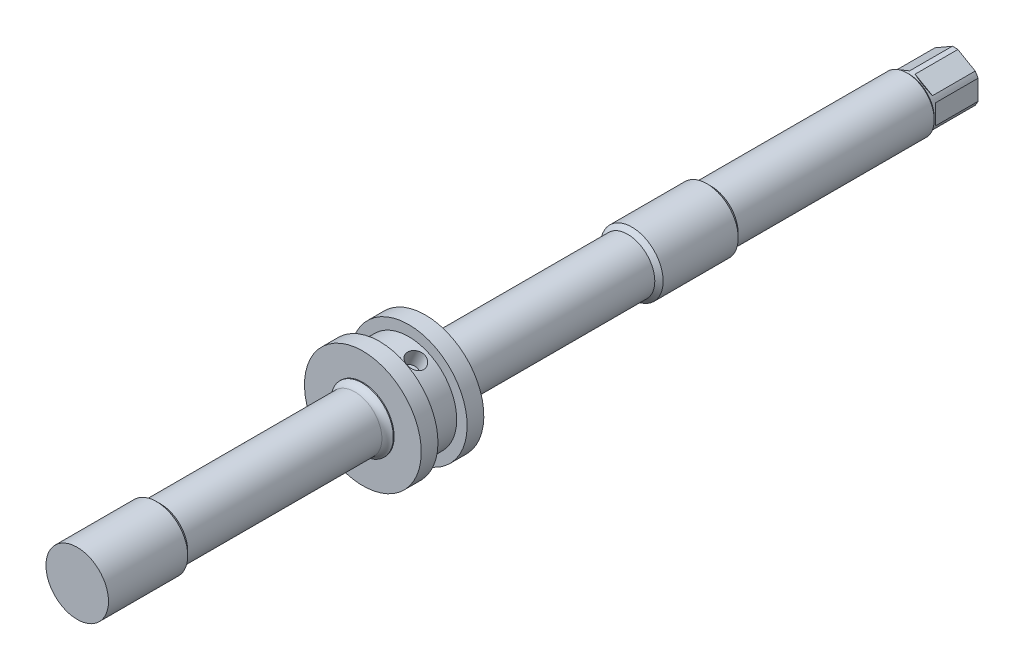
ISO-10303-21;
HEADER;
FILE_DESCRIPTION(('STEP AP214'),'2;1');
FILE_NAME('part.step','',(''),(''),'','','');
FILE_SCHEMA(('AUTOMOTIVE_DESIGN { 1 0 10303 214 1 1 1 1 }'));
ENDSEC;
DATA;
#1=APPLICATION_CONTEXT('core data for automotive mechanical design processes');
#2=APPLICATION_PROTOCOL_DEFINITION('international standard','automotive_design',2000,#1);
#3=PRODUCT_CONTEXT('',#1,'mechanical');
#4=PRODUCT('Part','Part','',(#3));
#5=PRODUCT_RELATED_PRODUCT_CATEGORY('part','',(#4));
#6=PRODUCT_DEFINITION_FORMATION('','',#4);
#7=PRODUCT_DEFINITION_CONTEXT('part definition',#1,'design');
#8=PRODUCT_DEFINITION('design','',#6,#7);
#9=PRODUCT_DEFINITION_SHAPE('','',#8);
#10=(LENGTH_UNIT() NAMED_UNIT(*) SI_UNIT(.MILLI.,.METRE.));
#11=(NAMED_UNIT(*) PLANE_ANGLE_UNIT() SI_UNIT($,.RADIAN.));
#12=(NAMED_UNIT(*) SI_UNIT($,.STERADIAN.) SOLID_ANGLE_UNIT());
#13=UNCERTAINTY_MEASURE_WITH_UNIT(LENGTH_MEASURE(1.E-05),#10,'distance_accuracy_value','');
#14=(GEOMETRIC_REPRESENTATION_CONTEXT(3) GLOBAL_UNCERTAINTY_ASSIGNED_CONTEXT((#13)) GLOBAL_UNIT_ASSIGNED_CONTEXT((#10,
#11,#12)) REPRESENTATION_CONTEXT('',''));
#15=CARTESIAN_POINT('',(0.,0.,0.));
#16=DIRECTION('',(0.,0.,1.));
#17=DIRECTION('',(1.,0.,0.));
#18=AXIS2_PLACEMENT_3D('',#15,#16,#17);
#19=CARTESIAN_POINT('',(0.,0.,-134.5));
#20=DIRECTION('',(0.,0.,-1.));
#21=DIRECTION('',(-1.,0.,0.));
#22=AXIS2_PLACEMENT_3D('',#19,#20,#21);
#23=PLANE('',#22);
#24=CARTESIAN_POINT('',(0.,0.,-134.5));
#25=DIRECTION('',(0.,0.,-1.));
#26=DIRECTION('',(-1.,0.,0.));
#27=AXIS2_PLACEMENT_3D('',#24,#25,#26);
#28=CIRCLE('',#27,6.);
#29=CARTESIAN_POINT('',(0.673344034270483,-5.96209760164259,-134.5));
#30=VERTEX_POINT('',#29);
#31=CARTESIAN_POINT('',(-0.673344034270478,-5.96209760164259,-134.5));
#32=VERTEX_POINT('',#31);
#33=EDGE_CURVE('E141',#30,#32,#28,.T.);
#34=ORIENTED_EDGE('',*,*,#33,.T.);
#35=DIRECTION('',(-0.86602540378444,0.5,0.));
#36=VECTOR('',#35,1.);
#37=CARTESIAN_POINT('',(-2.75,-4.7631397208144,-134.5));
#38=LINE('',#37,#36);
#39=CARTESIAN_POINT('',(-4.82665596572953,-3.56418183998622,-134.5));
#40=VERTEX_POINT('',#39);
#41=EDGE_CURVE('E125',#32,#40,#38,.T.);
#42=ORIENTED_EDGE('',*,*,#41,.T.);
#43=CARTESIAN_POINT('',(-5.5,-2.39791576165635,-134.5));
#44=VERTEX_POINT('',#43);
#45=EDGE_CURVE('E138',#40,#44,#28,.T.);
#46=ORIENTED_EDGE('',*,*,#45,.T.);
#47=DIRECTION('',(0.,1.,0.));
#48=VECTOR('',#47,1.);
#49=CARTESIAN_POINT('',(-5.5,0.,-134.5));
#50=LINE('',#49,#48);
#51=CARTESIAN_POINT('',(-5.5,2.39791576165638,-134.5));
#52=VERTEX_POINT('',#51);
#53=EDGE_CURVE('E143',#44,#52,#50,.T.);
#54=ORIENTED_EDGE('',*,*,#53,.T.);
#55=CARTESIAN_POINT('',(-4.82665596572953,3.56418183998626,-134.5));
#56=VERTEX_POINT('',#55);
#57=EDGE_CURVE('E41',#52,#56,#28,.T.);
#58=ORIENTED_EDGE('',*,*,#57,.T.);
#59=DIRECTION('',(0.86602540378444,0.5,0.));
#60=VECTOR('',#59,1.);
#61=CARTESIAN_POINT('',(-2.75,4.76313972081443,-134.5));
#62=LINE('',#61,#60);
#63=CARTESIAN_POINT('',(-0.673344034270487,5.96209760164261,-134.5));
#64=VERTEX_POINT('',#63);
#65=EDGE_CURVE('E34',#56,#64,#62,.T.);
#66=ORIENTED_EDGE('',*,*,#65,.T.);
#67=CARTESIAN_POINT('',(0.67334403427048,5.96209760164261,-134.5));
#68=VERTEX_POINT('',#67);
#69=EDGE_CURVE('E332',#64,#68,#28,.T.);
#70=ORIENTED_EDGE('',*,*,#69,.T.);
#71=DIRECTION('',(0.86602540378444,-0.5,0.));
#72=VECTOR('',#71,1.);
#73=CARTESIAN_POINT('',(2.75,4.76313972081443,-134.5));
#74=LINE('',#73,#72);
#75=CARTESIAN_POINT('',(4.82665596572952,3.56418183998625,-134.5));
#76=VERTEX_POINT('',#75);
#77=EDGE_CURVE('E146',#68,#76,#74,.T.);
#78=ORIENTED_EDGE('',*,*,#77,.T.);
#79=CARTESIAN_POINT('',(5.5,2.39791576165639,-134.5));
#80=VERTEX_POINT('',#79);
#81=EDGE_CURVE('E330',#76,#80,#28,.T.);
#82=ORIENTED_EDGE('',*,*,#81,.T.);
#83=DIRECTION('',(0.,-1.,0.));
#84=VECTOR('',#83,1.);
#85=CARTESIAN_POINT('',(5.5,0.,-134.5));
#86=LINE('',#85,#84);
#87=CARTESIAN_POINT('',(5.5,-2.39791576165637,-134.5));
#88=VERTEX_POINT('',#87);
#89=EDGE_CURVE('E149',#80,#88,#86,.T.);
#90=ORIENTED_EDGE('',*,*,#89,.T.);
#91=CARTESIAN_POINT('',(4.82665596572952,-3.56418183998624,-134.5));
#92=VERTEX_POINT('',#91);
#93=EDGE_CURVE('E329',#88,#92,#28,.T.);
#94=ORIENTED_EDGE('',*,*,#93,.T.);
#95=DIRECTION('',(-0.86602540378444,-0.5,0.));
#96=VECTOR('',#95,1.);
#97=CARTESIAN_POINT('',(2.75,-4.7631397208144,-134.5));
#98=LINE('',#97,#96);
#99=EDGE_CURVE('E152',#92,#30,#98,.T.);
#100=ORIENTED_EDGE('',*,*,#99,.T.);
#101=EDGE_LOOP('',(#34,#42,#46,#54,#58,#66,#70,#78,#82,#90,#94,#100));
#102=FACE_BOUND('',#101,.T.);
#103=ADVANCED_FACE('F18',(#102),#23,.T.);
#104=CARTESIAN_POINT('',(0.,-6.35085296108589,-124.25));
#105=DIRECTION('',(-0.353553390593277,-0.612372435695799,-0.707106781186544));
#106=DIRECTION('',(0.,0.755928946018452,-0.654653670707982));
#107=AXIS2_PLACEMENT_3D('',#104,#105,#106);
#108=PLANE('',#107);
#109=DIRECTION('',(0.86602540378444,-0.5,0.));
#110=VECTOR('',#109,1.);
#111=CARTESIAN_POINT('',(0.,-6.35085296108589,-124.25));
#112=LINE('',#111,#110);
#113=CARTESIAN_POINT('',(-0.673344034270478,-5.9620976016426,-124.25));
#114=VERTEX_POINT('',#113);
#115=CARTESIAN_POINT('',(-4.82665596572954,-3.56418183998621,-124.25));
#116=VERTEX_POINT('',#115);
#117=EDGE_CURVE('E110',#114,#116,#112,.F.);
#118=ORIENTED_EDGE('',*,*,#117,.F.);
#119=CARTESIAN_POINT('',(0.,0.,-129.75));
#120=DIRECTION('',(-0.353553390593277,-0.612372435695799,-0.707106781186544));
#121=DIRECTION('',(-0.353553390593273,-0.612372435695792,0.707106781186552));
#122=AXIS2_PLACEMENT_3D('',#119,#120,#121);
#123=ELLIPSE('',#122,8.48528137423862,6.);
#124=EDGE_CURVE('E114',#116,#114,#123,.F.);
#125=ORIENTED_EDGE('',*,*,#124,.F.);
#126=EDGE_LOOP('',(#118,#125));
#127=FACE_BOUND('',#126,.T.);
#128=ADVANCED_FACE('F112',(#127),#108,.T.);
#129=CARTESIAN_POINT('',(0.,-6.35085296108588,-122.75));
#130=DIRECTION('',(-0.5,-0.86602540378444,0.));
#131=DIRECTION('',(0.86602540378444,-0.5,0.));
#132=AXIS2_PLACEMENT_3D('',#129,#130,#131);
#133=PLANE('',#132);
#134=ORIENTED_EDGE('',*,*,#41,.F.);
#135=DIRECTION('',(0.,0.,1.));
#136=VECTOR('',#135,1.);
#137=CARTESIAN_POINT('',(-0.67334403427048,-5.96209760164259,-134.5));
#138=LINE('',#137,#136);
#139=EDGE_CURVE('E122',#114,#32,#138,.F.);
#140=ORIENTED_EDGE('',*,*,#139,.F.);
#141=ORIENTED_EDGE('',*,*,#117,.T.);
#142=DIRECTION('',(0.,0.,1.));
#143=VECTOR('',#142,1.);
#144=CARTESIAN_POINT('',(-4.82665596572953,-3.56418183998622,-134.5));
#145=LINE('',#144,#143);
#146=EDGE_CURVE('E130',#40,#116,#145,.T.);
#147=ORIENTED_EDGE('',*,*,#146,.F.);
#148=EDGE_LOOP('',(#134,#140,#141,#147));
#149=FACE_BOUND('',#148,.T.);
#150=ADVANCED_FACE('F123',(#149),#133,.T.);
#151=CARTESIAN_POINT('',(5.5,-3.17542648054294,-124.25));
#152=DIRECTION('',(0.353553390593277,-0.612372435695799,-0.707106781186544));
#153=DIRECTION('',(0.,0.755928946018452,-0.654653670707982));
#154=AXIS2_PLACEMENT_3D('',#151,#152,#153);
#155=PLANE('',#154);
#156=DIRECTION('',(0.86602540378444,0.5,0.));
#157=VECTOR('',#156,1.);
#158=CARTESIAN_POINT('',(5.5,-3.17542648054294,-124.25));
#159=LINE('',#158,#157);
#160=CARTESIAN_POINT('',(4.82665596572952,-3.56418183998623,-124.25));
#161=VERTEX_POINT('',#160);
#162=CARTESIAN_POINT('',(0.67334403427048,-5.96209760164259,-124.25));
#163=VERTEX_POINT('',#162);
#164=EDGE_CURVE('E117',#161,#163,#159,.F.);
#165=ORIENTED_EDGE('',*,*,#164,.F.);
#166=CARTESIAN_POINT('',(0.,0.,-129.75));
#167=DIRECTION('',(0.353553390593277,-0.612372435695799,-0.707106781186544));
#168=DIRECTION('',(0.353553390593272,-0.612372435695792,0.707106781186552));
#169=AXIS2_PLACEMENT_3D('',#166,#167,#168);
#170=ELLIPSE('',#169,8.48528137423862,6.);
#171=EDGE_CURVE('E136',#163,#161,#170,.F.);
#172=ORIENTED_EDGE('',*,*,#171,.F.);
#173=EDGE_LOOP('',(#165,#172));
#174=FACE_BOUND('',#173,.T.);
#175=ADVANCED_FACE('F364',(#174),#155,.T.);
#176=CARTESIAN_POINT('',(5.5,-3.17542648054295,-122.75));
#177=DIRECTION('',(0.5,-0.86602540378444,0.));
#178=DIRECTION('',(0.86602540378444,0.5,0.));
#179=AXIS2_PLACEMENT_3D('',#176,#177,#178);
#180=PLANE('',#179);
#181=ORIENTED_EDGE('',*,*,#99,.F.);
#182=DIRECTION('',(0.,0.,1.));
#183=VECTOR('',#182,1.);
#184=CARTESIAN_POINT('',(4.82665596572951,-3.56418183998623,-134.5));
#185=LINE('',#184,#183);
#186=EDGE_CURVE('E256',#161,#92,#185,.F.);
#187=ORIENTED_EDGE('',*,*,#186,.F.);
#188=ORIENTED_EDGE('',*,*,#164,.T.);
#189=DIRECTION('',(0.,0.,1.));
#190=VECTOR('',#189,1.);
#191=CARTESIAN_POINT('',(0.67334403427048,-5.96209760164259,-134.5));
#192=LINE('',#191,#190);
#193=EDGE_CURVE('E126',#30,#163,#192,.T.);
#194=ORIENTED_EDGE('',*,*,#193,.F.);
#195=EDGE_LOOP('',(#181,#187,#188,#194));
#196=FACE_BOUND('',#195,.T.);
#197=ADVANCED_FACE('F363',(#196),#180,.T.);
#198=CARTESIAN_POINT('',(-5.5,-3.17542648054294,-124.25));
#199=DIRECTION('',(-0.707106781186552,0.,-0.707106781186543));
#200=DIRECTION('',(-0.707106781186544,0.,0.707106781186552));
#201=AXIS2_PLACEMENT_3D('',#198,#199,#200);
#202=PLANE('',#201);
#203=DIRECTION('',(0.,1.,0.));
#204=VECTOR('',#203,1.);
#205=CARTESIAN_POINT('',(-5.5,-3.17542648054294,-124.25));
#206=LINE('',#205,#204);
#207=CARTESIAN_POINT('',(-5.5,-2.39791576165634,-124.25));
#208=VERTEX_POINT('',#207);
#209=CARTESIAN_POINT('',(-5.5,2.39791576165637,-124.25));
#210=VERTEX_POINT('',#209);
#211=EDGE_CURVE('E262',#208,#210,#206,.T.);
#212=ORIENTED_EDGE('',*,*,#211,.F.);
#213=CARTESIAN_POINT('',(0.,0.,-129.75));
#214=DIRECTION('',(-0.707106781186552,0.,-0.707106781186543));
#215=DIRECTION('',(-0.707106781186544,0.,0.707106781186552));
#216=AXIS2_PLACEMENT_3D('',#213,#214,#215);
#217=ELLIPSE('',#216,8.48528137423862,6.);
#218=EDGE_CURVE('E255',#210,#208,#217,.F.);
#219=ORIENTED_EDGE('',*,*,#218,.F.);
#220=EDGE_LOOP('',(#212,#219));
#221=FACE_BOUND('',#220,.T.);
#222=ADVANCED_FACE('F324',(#221),#202,.T.);
#223=CARTESIAN_POINT('',(5.5,3.17542648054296,-124.25));
#224=DIRECTION('',(0.707106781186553,0.,-0.707106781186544));
#225=DIRECTION('',(-0.707106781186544,0.,-0.707106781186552));
#226=AXIS2_PLACEMENT_3D('',#223,#224,#225);
#227=PLANE('',#226);
#228=CARTESIAN_POINT('',(0.,0.,-129.75));
#229=DIRECTION('',(0.707106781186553,0.,-0.707106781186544));
#230=DIRECTION('',(0.707106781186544,0.,0.707106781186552));
#231=AXIS2_PLACEMENT_3D('',#228,#229,#230);
#232=ELLIPSE('',#231,8.48528137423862,6.);
#233=CARTESIAN_POINT('',(5.5,-2.39791576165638,-124.25));
#234=VERTEX_POINT('',#233);
#235=CARTESIAN_POINT('',(5.5,2.39791576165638,-124.25));
#236=VERTEX_POINT('',#235);
#237=EDGE_CURVE('E252',#234,#236,#232,.F.);
#238=ORIENTED_EDGE('',*,*,#237,.F.);
#239=DIRECTION('',(0.,1.,0.));
#240=VECTOR('',#239,1.);
#241=CARTESIAN_POINT('',(5.5,3.17542648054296,-124.25));
#242=LINE('',#241,#240);
#243=EDGE_CURVE('E271',#236,#234,#242,.F.);
#244=ORIENTED_EDGE('',*,*,#243,.F.);
#245=EDGE_LOOP('',(#238,#244));
#246=FACE_BOUND('',#245,.T.);
#247=ADVANCED_FACE('F358',(#246),#227,.T.);
#248=CARTESIAN_POINT('',(5.5,3.17542648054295,-122.75));
#249=DIRECTION('',(1.,0.,0.));
#250=DIRECTION('',(0.,1.,0.));
#251=AXIS2_PLACEMENT_3D('',#248,#249,#250);
#252=PLANE('',#251);
#253=ORIENTED_EDGE('',*,*,#89,.F.);
#254=DIRECTION('',(0.,0.,1.));
#255=VECTOR('',#254,1.);
#256=CARTESIAN_POINT('',(5.5,2.39791576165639,-134.5));
#257=LINE('',#256,#255);
#258=EDGE_CURVE('E249',#236,#80,#257,.F.);
#259=ORIENTED_EDGE('',*,*,#258,.F.);
#260=ORIENTED_EDGE('',*,*,#243,.T.);
#261=DIRECTION('',(0.,0.,1.));
#262=VECTOR('',#261,1.);
#263=CARTESIAN_POINT('',(5.5,-2.39791576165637,-134.5));
#264=LINE('',#263,#262);
#265=EDGE_CURVE('E253',#88,#234,#264,.T.);
#266=ORIENTED_EDGE('',*,*,#265,.F.);
#267=EDGE_LOOP('',(#253,#259,#260,#266));
#268=FACE_BOUND('',#267,.T.);
#269=ADVANCED_FACE('F356',(#268),#252,.T.);
#270=CARTESIAN_POINT('',(0.,6.35085296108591,-124.25));
#271=DIRECTION('',(0.353553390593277,0.612372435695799,-0.707106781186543));
#272=DIRECTION('',(0.,0.755928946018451,0.654653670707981));
#273=AXIS2_PLACEMENT_3D('',#270,#271,#272);
#274=PLANE('',#273);
#275=DIRECTION('',(-0.86602540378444,0.5,0.));
#276=VECTOR('',#275,1.);
#277=CARTESIAN_POINT('',(0.,6.35085296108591,-124.25));
#278=LINE('',#277,#276);
#279=CARTESIAN_POINT('',(0.673344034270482,5.96209760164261,-124.25));
#280=VERTEX_POINT('',#279);
#281=CARTESIAN_POINT('',(4.82665596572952,3.56418183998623,-124.25));
#282=VERTEX_POINT('',#281);
#283=EDGE_CURVE('E268',#280,#282,#278,.F.);
#284=ORIENTED_EDGE('',*,*,#283,.F.);
#285=CARTESIAN_POINT('',(0.,0.,-129.75));
#286=DIRECTION('',(0.353553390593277,0.612372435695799,-0.707106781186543));
#287=DIRECTION('',(0.353553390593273,0.612372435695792,0.707106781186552));
#288=AXIS2_PLACEMENT_3D('',#285,#286,#287);
#289=ELLIPSE('',#288,8.48528137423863,6.);
#290=EDGE_CURVE('E246',#282,#280,#289,.F.);
#291=ORIENTED_EDGE('',*,*,#290,.F.);
#292=EDGE_LOOP('',(#284,#291));
#293=FACE_BOUND('',#292,.T.);
#294=ADVANCED_FACE('F347',(#293),#274,.T.);
#295=CARTESIAN_POINT('',(0.,6.3508529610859,-122.75));
#296=DIRECTION('',(0.5,0.86602540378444,0.));
#297=DIRECTION('',(-0.86602540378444,0.5,0.));
#298=AXIS2_PLACEMENT_3D('',#295,#296,#297);
#299=PLANE('',#298);
#300=ORIENTED_EDGE('',*,*,#77,.F.);
#301=DIRECTION('',(0.,0.,1.));
#302=VECTOR('',#301,1.);
#303=CARTESIAN_POINT('',(0.67334403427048,5.96209760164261,-134.5));
#304=LINE('',#303,#302);
#305=EDGE_CURVE('E243',#280,#68,#304,.F.);
#306=ORIENTED_EDGE('',*,*,#305,.F.);
#307=ORIENTED_EDGE('',*,*,#283,.T.);
#308=DIRECTION('',(0.,0.,1.));
#309=VECTOR('',#308,1.);
#310=CARTESIAN_POINT('',(4.82665596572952,3.56418183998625,-134.5));
#311=LINE('',#310,#309);
#312=EDGE_CURVE('E247',#76,#282,#311,.T.);
#313=ORIENTED_EDGE('',*,*,#312,.F.);
#314=EDGE_LOOP('',(#300,#306,#307,#313));
#315=FACE_BOUND('',#314,.T.);
#316=ADVANCED_FACE('F339',(#315),#299,.T.);
#317=CARTESIAN_POINT('',(-5.5,3.17542648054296,-124.25));
#318=DIRECTION('',(-0.353553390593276,0.6123724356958,-0.707106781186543));
#319=DIRECTION('',(0.,0.755928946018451,0.654653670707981));
#320=AXIS2_PLACEMENT_3D('',#317,#318,#319);
#321=PLANE('',#320);
#322=DIRECTION('',(-0.86602540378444,-0.5,0.));
#323=VECTOR('',#322,1.);
#324=CARTESIAN_POINT('',(-5.5,3.17542648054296,-124.25));
#325=LINE('',#324,#323);
#326=CARTESIAN_POINT('',(-4.82665596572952,3.56418183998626,-124.25));
#327=VERTEX_POINT('',#326);
#328=CARTESIAN_POINT('',(-0.67334403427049,5.9620976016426,-124.25));
#329=VERTEX_POINT('',#328);
#330=EDGE_CURVE('E265',#327,#329,#325,.F.);
#331=ORIENTED_EDGE('',*,*,#330,.F.);
#332=CARTESIAN_POINT('',(0.,0.,-129.75));
#333=DIRECTION('',(-0.353553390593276,0.6123724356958,-0.707106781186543));
#334=DIRECTION('',(-0.353553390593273,0.612372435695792,0.707106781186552));
#335=AXIS2_PLACEMENT_3D('',#332,#333,#334);
#336=ELLIPSE('',#335,8.48528137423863,6.);
#337=EDGE_CURVE('E240',#329,#327,#336,.F.);
#338=ORIENTED_EDGE('',*,*,#337,.F.);
#339=EDGE_LOOP('',(#331,#338));
#340=FACE_BOUND('',#339,.T.);
#341=ADVANCED_FACE('F337',(#340),#321,.T.);
#342=CARTESIAN_POINT('',(-5.5,3.17542648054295,-122.75));
#343=DIRECTION('',(-0.5,0.86602540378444,0.));
#344=DIRECTION('',(-0.86602540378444,-0.5,0.));
#345=AXIS2_PLACEMENT_3D('',#342,#343,#344);
#346=PLANE('',#345);
#347=ORIENTED_EDGE('',*,*,#65,.F.);
#348=DIRECTION('',(0.,0.,1.));
#349=VECTOR('',#348,1.);
#350=CARTESIAN_POINT('',(-4.82665596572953,3.56418183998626,-134.5));
#351=LINE('',#350,#349);
#352=EDGE_CURVE('E238',#327,#56,#351,.F.);
#353=ORIENTED_EDGE('',*,*,#352,.F.);
#354=ORIENTED_EDGE('',*,*,#330,.T.);
#355=DIRECTION('',(0.,0.,1.));
#356=VECTOR('',#355,1.);
#357=CARTESIAN_POINT('',(-0.673344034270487,5.96209760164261,-134.5));
#358=LINE('',#357,#356);
#359=EDGE_CURVE('E241',#64,#329,#358,.T.);
#360=ORIENTED_EDGE('',*,*,#359,.F.);
#361=EDGE_LOOP('',(#347,#353,#354,#360));
#362=FACE_BOUND('',#361,.T.);
#363=ADVANCED_FACE('F335',(#362),#346,.T.);
#364=CARTESIAN_POINT('',(-5.5,-3.17542648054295,-122.75));
#365=DIRECTION('',(-1.,0.,0.));
#366=DIRECTION('',(0.,0.,1.));
#367=AXIS2_PLACEMENT_3D('',#364,#365,#366);
#368=PLANE('',#367);
#369=ORIENTED_EDGE('',*,*,#53,.F.);
#370=DIRECTION('',(0.,0.,1.));
#371=VECTOR('',#370,1.);
#372=CARTESIAN_POINT('',(-5.5,-2.39791576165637,-134.5));
#373=LINE('',#372,#371);
#374=EDGE_CURVE('E132',#208,#44,#373,.F.);
#375=ORIENTED_EDGE('',*,*,#374,.F.);
#376=ORIENTED_EDGE('',*,*,#211,.T.);
#377=DIRECTION('',(0.,0.,1.));
#378=VECTOR('',#377,1.);
#379=CARTESIAN_POINT('',(-5.5,2.39791576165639,-134.5));
#380=LINE('',#379,#378);
#381=EDGE_CURVE('E236',#52,#210,#380,.T.);
#382=ORIENTED_EDGE('',*,*,#381,.F.);
#383=EDGE_LOOP('',(#369,#375,#376,#382));
#384=FACE_BOUND('',#383,.T.);
#385=ADVANCED_FACE('F326',(#384),#368,.T.);
#386=CARTESIAN_POINT('',(0.,0.,-134.5));
#387=DIRECTION('',(0.,0.,1.));
#388=DIRECTION('',(1.,0.,0.));
#389=AXIS2_PLACEMENT_3D('',#386,#387,#388);
#390=CYLINDRICAL_SURFACE('',#389,6.);
#391=ORIENTED_EDGE('',*,*,#57,.F.);
#392=ORIENTED_EDGE('',*,*,#381,.T.);
#393=ORIENTED_EDGE('',*,*,#218,.T.);
#394=ORIENTED_EDGE('',*,*,#374,.T.);
#395=ORIENTED_EDGE('',*,*,#45,.F.);
#396=ORIENTED_EDGE('',*,*,#146,.T.);
#397=ORIENTED_EDGE('',*,*,#124,.T.);
#398=ORIENTED_EDGE('',*,*,#139,.T.);
#399=ORIENTED_EDGE('',*,*,#33,.F.);
#400=ORIENTED_EDGE('',*,*,#193,.T.);
#401=ORIENTED_EDGE('',*,*,#171,.T.);
#402=ORIENTED_EDGE('',*,*,#186,.T.);
#403=ORIENTED_EDGE('',*,*,#93,.F.);
#404=ORIENTED_EDGE('',*,*,#265,.T.);
#405=ORIENTED_EDGE('',*,*,#237,.T.);
#406=ORIENTED_EDGE('',*,*,#258,.T.);
#407=ORIENTED_EDGE('',*,*,#81,.F.);
#408=ORIENTED_EDGE('',*,*,#312,.T.);
#409=ORIENTED_EDGE('',*,*,#290,.T.);
#410=ORIENTED_EDGE('',*,*,#305,.T.);
#411=ORIENTED_EDGE('',*,*,#69,.F.);
#412=ORIENTED_EDGE('',*,*,#359,.T.);
#413=ORIENTED_EDGE('',*,*,#337,.T.);
#414=ORIENTED_EDGE('',*,*,#352,.T.);
#415=EDGE_LOOP('',(#391,#392,#393,#394,#395,#396,#397,#398,#399,#400,#401,#402,#403,#404,#405,
#406,#407,#408,#409,#410,#411,#412,#413,#414));
#416=FACE_BOUND('',#415,.T.);
#417=CARTESIAN_POINT('',(0.,0.,-123.500000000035));
#418=DIRECTION('',(0.,0.,1.));
#419=DIRECTION('',(1.,0.,0.));
#420=AXIS2_PLACEMENT_3D('',#417,#418,#419);
#421=CIRCLE('',#420,5.99999999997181);
#422=CARTESIAN_POINT('',(5.9999999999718,0.,-123.500000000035));
#423=VERTEX_POINT('',#422);
#424=EDGE_CURVE('E235',#423,#423,#421,.T.);
#425=ORIENTED_EDGE('',*,*,#424,.F.);
#426=EDGE_LOOP('',(#425));
#427=FACE_BOUND('',#426,.T.);
#428=ADVANCED_FACE('F128',(#416,#427),#390,.T.);
#429=CARTESIAN_POINT('',(0.,0.,-122.999999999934));
#430=DIRECTION('',(0.,0.,1.));
#431=DIRECTION('',(1.,0.,0.));
#432=AXIS2_PLACEMENT_3D('',#429,#430,#431);
#433=CONICAL_SURFACE('',#432,6.50000000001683,0.785398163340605);
#434=CARTESIAN_POINT('',(0.,0.,-123.));
#435=DIRECTION('',(0.,0.,-1.));
#436=DIRECTION('',(-1.,0.,0.));
#437=AXIS2_PLACEMENT_3D('',#434,#435,#436);
#438=CIRCLE('',#437,6.5);
#439=CARTESIAN_POINT('',(-6.5,0.,-123.));
#440=VERTEX_POINT('',#439);
#441=EDGE_CURVE('E232',#440,#440,#438,.F.);
#442=ORIENTED_EDGE('',*,*,#441,.F.);
#443=EDGE_LOOP('',(#442));
#444=FACE_BOUND('',#443,.T.);
#445=ORIENTED_EDGE('',*,*,#424,.T.);
#446=EDGE_LOOP('',(#445));
#447=FACE_BOUND('',#446,.T.);
#448=ADVANCED_FACE('F352',(#444,#447),#433,.T.);
#449=CARTESIAN_POINT('',(0.,0.,-76.));
#450=DIRECTION('',(0.,0.,-1.));
#451=DIRECTION('',(-1.,0.,0.));
#452=AXIS2_PLACEMENT_3D('',#449,#450,#451);
#453=CYLINDRICAL_SURFACE('',#452,6.5);
#454=ORIENTED_EDGE('',*,*,#441,.T.);
#455=EDGE_LOOP('',(#454));
#456=FACE_BOUND('',#455,.T.);
#457=CARTESIAN_POINT('',(0.,0.,-75.999999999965));
#458=DIRECTION('',(0.,0.,1.));
#459=DIRECTION('',(1.,0.,0.));
#460=AXIS2_PLACEMENT_3D('',#457,#458,#459);
#461=CIRCLE('',#460,6.50000000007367);
#462=CARTESIAN_POINT('',(6.50000000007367,0.,-75.999999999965));
#463=VERTEX_POINT('',#462);
#464=EDGE_CURVE('E228',#463,#463,#461,.T.);
#465=ORIENTED_EDGE('',*,*,#464,.F.);
#466=EDGE_LOOP('',(#465));
#467=FACE_BOUND('',#466,.T.);
#468=ADVANCED_FACE('F396',(#456,#467),#453,.T.);
#469=CARTESIAN_POINT('',(0.,0.,-75.0000000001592));
#470=DIRECTION('',(0.,0.,1.));
#471=DIRECTION('',(1.,0.,0.));
#472=AXIS2_PLACEMENT_3D('',#469,#470,#471);
#473=CONICAL_SURFACE('',#472,7.49999999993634,0.785398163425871);
#474=CARTESIAN_POINT('',(0.,0.,-75.));
#475=DIRECTION('',(0.,0.,-1.));
#476=DIRECTION('',(-1.,0.,0.));
#477=AXIS2_PLACEMENT_3D('',#474,#475,#476);
#478=CIRCLE('',#477,7.5);
#479=CARTESIAN_POINT('',(-7.5,0.,-75.));
#480=VERTEX_POINT('',#479);
#481=EDGE_CURVE('E220',#480,#480,#478,.F.);
#482=ORIENTED_EDGE('',*,*,#481,.F.);
#483=EDGE_LOOP('',(#482));
#484=FACE_BOUND('',#483,.T.);
#485=ORIENTED_EDGE('',*,*,#464,.T.);
#486=EDGE_LOOP('',(#485));
#487=FACE_BOUND('',#486,.T.);
#488=ADVANCED_FACE('F476',(#484,#487),#473,.T.);
#489=CARTESIAN_POINT('',(0.,0.,122.5));
#490=DIRECTION('',(0.,0.,-1.));
#491=DIRECTION('',(-1.,0.,0.));
#492=AXIS2_PLACEMENT_3D('',#489,#490,#491);
#493=CYLINDRICAL_SURFACE('',#492,7.5);
#494=ORIENTED_EDGE('',*,*,#481,.T.);
#495=EDGE_LOOP('',(#494));
#496=FACE_BOUND('',#495,.T.);
#497=CARTESIAN_POINT('',(0.,0.,-57.));
#498=DIRECTION('',(0.,0.,-1.));
#499=DIRECTION('',(-1.,0.,0.));
#500=AXIS2_PLACEMENT_3D('',#497,#498,#499);
#501=CIRCLE('',#500,7.5);
#502=CARTESIAN_POINT('',(-7.50000000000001,0.,-57.));
#503=VERTEX_POINT('',#502);
#504=EDGE_CURVE('E215',#503,#503,#501,.F.);
#505=ORIENTED_EDGE('',*,*,#504,.F.);
#506=EDGE_LOOP('',(#505));
#507=FACE_BOUND('',#506,.T.);
#508=ADVANCED_FACE('F483',(#496,#507),#493,.T.);
#509=CARTESIAN_POINT('',(0.,0.,-57.));
#510=DIRECTION('',(0.,0.,-1.));
#511=DIRECTION('',(-1.,0.,0.));
#512=AXIS2_PLACEMENT_3D('',#509,#510,#511);
#513=CONICAL_SURFACE('',#512,7.5,0.785398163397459);
#514=ORIENTED_EDGE('',*,*,#504,.T.);
#515=EDGE_LOOP('',(#514));
#516=FACE_BOUND('',#515,.T.);
#517=CARTESIAN_POINT('',(0.,0.,-56.));
#518=DIRECTION('',(0.,0.,1.));
#519=DIRECTION('',(1.,0.,0.));
#520=AXIS2_PLACEMENT_3D('',#517,#518,#519);
#521=CIRCLE('',#520,6.5);
#522=CARTESIAN_POINT('',(6.49999999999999,0.,-56.));
#523=VERTEX_POINT('',#522);
#524=EDGE_CURVE('E213',#523,#523,#521,.T.);
#525=ORIENTED_EDGE('',*,*,#524,.F.);
#526=EDGE_LOOP('',(#525));
#527=FACE_BOUND('',#526,.T.);
#528=ADVANCED_FACE('F199',(#516,#527),#513,.T.);
#529=CARTESIAN_POINT('',(0.,0.,-8.5));
#530=DIRECTION('',(0.,0.,1.));
#531=DIRECTION('',(1.,0.,0.));
#532=AXIS2_PLACEMENT_3D('',#529,#530,#531);
#533=TOROIDAL_SURFACE('',#532,7.50000000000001,1.);
#534=CARTESIAN_POINT('',(0.,0.,-7.5));
#535=DIRECTION('',(0.,0.,1.));
#536=DIRECTION('',(1.,0.,0.));
#537=AXIS2_PLACEMENT_3D('',#534,#535,#536);
#538=CIRCLE('',#537,7.5);
#539=CARTESIAN_POINT('',(7.49999999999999,0.,-7.5));
#540=VERTEX_POINT('',#539);
#541=EDGE_CURVE('E218',#540,#540,#538,.T.);
#542=ORIENTED_EDGE('',*,*,#541,.F.);
#543=EDGE_LOOP('',(#542));
#544=FACE_BOUND('',#543,.T.);
#545=CARTESIAN_POINT('',(0.,0.,-8.5));
#546=DIRECTION('',(0.,0.,1.));
#547=DIRECTION('',(1.,0.,0.));
#548=AXIS2_PLACEMENT_3D('',#545,#546,#547);
#549=CIRCLE('',#548,6.5);
#550=CARTESIAN_POINT('',(6.49999999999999,0.,-8.5));
#551=VERTEX_POINT('',#550);
#552=EDGE_CURVE('E142',#551,#551,#549,.F.);
#553=ORIENTED_EDGE('',*,*,#552,.F.);
#554=EDGE_LOOP('',(#553));
#555=FACE_BOUND('',#554,.T.);
#556=ADVANCED_FACE('F188',(#544,#555),#533,.F.);
#557=CARTESIAN_POINT('',(0.,0.,-56.));
#558=DIRECTION('',(0.,0.,1.));
#559=DIRECTION('',(1.,0.,0.));
#560=AXIS2_PLACEMENT_3D('',#557,#558,#559);
#561=CYLINDRICAL_SURFACE('',#560,6.5);
#562=ORIENTED_EDGE('',*,*,#552,.T.);
#563=EDGE_LOOP('',(#562));
#564=FACE_BOUND('',#563,.T.);
#565=ORIENTED_EDGE('',*,*,#524,.T.);
#566=EDGE_LOOP('',(#565));
#567=FACE_BOUND('',#566,.T.);
#568=ADVANCED_FACE('F178',(#564,#567),#561,.T.);
#569=CARTESIAN_POINT('',(4.73331846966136,10.4807297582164,-0.5));
#570=DIRECTION('',(0.411592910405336,0.911367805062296,0.));
#571=DIRECTION('',(-0.911367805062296,0.411592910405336,0.));
#572=AXIS2_PLACEMENT_3D('',#569,#570,#571);
#573=CYLINDRICAL_SURFACE('',#572,2.1);
#574=CARTESIAN_POINT('',(3.08694682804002,6.83525853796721,-2.6));
#575=CARTESIAN_POINT('',(3.19225391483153,6.78769799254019,-2.59999773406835));
#576=CARTESIAN_POINT('',(3.29647392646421,6.7376731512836,-2.59043129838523));
#577=CARTESIAN_POINT('',(3.49976841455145,6.63435324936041,-2.5524949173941));
#578=CARTESIAN_POINT('',(3.59884076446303,6.58105685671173,-2.52411726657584));
#579=CARTESIAN_POINT('',(3.78916724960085,6.47334230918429,-2.44956402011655));
#580=CARTESIAN_POINT('',(3.88043182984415,6.41892577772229,-2.40341267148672));
#581=CARTESIAN_POINT('',(4.05331672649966,6.31118159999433,-2.29471573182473));
#582=CARTESIAN_POINT('',(4.13493614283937,6.25785405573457,-2.23216861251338));
#583=CARTESIAN_POINT('',(4.28875228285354,6.15349067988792,-2.09078314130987));
#584=CARTESIAN_POINT('',(4.36069170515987,6.10253483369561,-2.01160582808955));
#585=CARTESIAN_POINT('',(4.49165164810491,6.00680111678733,-1.83993123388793));
#586=CARTESIAN_POINT('',(4.55067031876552,5.96202413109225,-1.74743204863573));
#587=CARTESIAN_POINT('',(4.65577378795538,5.88033159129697,-1.54955551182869));
#588=CARTESIAN_POINT('',(4.70158867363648,5.84358337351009,-1.44396510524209));
#589=CARTESIAN_POINT('',(4.77784525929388,5.78140403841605,-1.22424305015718));
#590=CARTESIAN_POINT('',(4.80829011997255,5.75597059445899,-1.11011316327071));
#591=CARTESIAN_POINT('',(4.85259603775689,5.71866572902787,-0.879530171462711));
#592=CARTESIAN_POINT('',(4.86684831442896,5.7064747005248,-0.763204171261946));
#593=CARTESIAN_POINT('',(4.87977545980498,5.69542536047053,-0.529073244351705));
#594=CARTESIAN_POINT('',(4.87845356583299,5.69656427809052,-0.411268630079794));
#595=CARTESIAN_POINT('',(4.86055657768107,5.71183974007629,-0.181394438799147));
#596=CARTESIAN_POINT('',(4.8444556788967,5.72557219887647,-0.0692602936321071));
#597=CARTESIAN_POINT('',(4.79801546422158,5.76454313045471,0.149938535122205));
#598=CARTESIAN_POINT('',(4.76767490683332,5.78978260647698,0.25700277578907));
#599=CARTESIAN_POINT('',(4.69288455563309,5.85057025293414,0.464545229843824));
#600=CARTESIAN_POINT('',(4.64826657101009,5.88624084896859,0.564926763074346));
#601=CARTESIAN_POINT('',(4.54581748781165,5.96571334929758,0.755184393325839));
#602=CARTESIAN_POINT('',(4.48798355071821,6.0095170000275,0.845058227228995));
#603=CARTESIAN_POINT('',(4.35772073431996,6.10466984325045,1.01515939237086));
#604=CARTESIAN_POINT('',(4.28484010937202,6.15623444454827,1.09492099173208));
#605=CARTESIAN_POINT('',(4.12718668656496,6.26301694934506,1.23871469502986));
#606=CARTESIAN_POINT('',(4.04241332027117,6.31823502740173,1.30274604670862));
#607=CARTESIAN_POINT('',(3.8621901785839,6.42999009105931,1.41349619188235));
#608=CARTESIAN_POINT('',(3.76668725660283,6.48653243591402,1.4601233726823));
#609=CARTESIAN_POINT('',(3.56764851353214,6.59809666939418,1.53403266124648));
#610=CARTESIAN_POINT('',(3.46411464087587,6.65311892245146,1.561319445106));
#611=CARTESIAN_POINT('',(3.25523668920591,6.75770997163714,1.59502512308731));
#612=CARTESIAN_POINT('',(3.15005329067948,6.80739617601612,1.60207640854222));
#613=CARTESIAN_POINT('',(2.93788286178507,6.90161667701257,1.59686744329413));
#614=CARTESIAN_POINT('',(2.83089603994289,6.94615156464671,1.58460941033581));
#615=CARTESIAN_POINT('',(2.6204239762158,7.02822192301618,1.54164589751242));
#616=CARTESIAN_POINT('',(2.51691096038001,7.06587551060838,1.51129964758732));
#617=CARTESIAN_POINT('',(2.31431677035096,7.13480188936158,1.43344407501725));
#618=CARTESIAN_POINT('',(2.21523610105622,7.16607395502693,1.38593280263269));
#619=CARTESIAN_POINT('',(2.02237897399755,7.22290179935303,1.27396648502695));
#620=CARTESIAN_POINT('',(1.92875795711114,7.248323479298,1.20917600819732));
#621=CARTESIAN_POINT('',(1.7519472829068,7.29307978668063,1.06490648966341));
#622=CARTESIAN_POINT('',(1.66875991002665,7.31241308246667,0.985424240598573));
#623=CARTESIAN_POINT('',(1.51301593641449,7.34624678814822,0.811066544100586));
#624=CARTESIAN_POINT('',(1.44087388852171,7.36057686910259,0.715786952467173));
#625=CARTESIAN_POINT('',(1.31306737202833,7.38444966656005,0.514200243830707));
#626=CARTESIAN_POINT('',(1.25740228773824,7.39399256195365,0.40789353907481));
#627=CARTESIAN_POINT('',(1.16506316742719,7.40910377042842,0.187743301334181));
#628=CARTESIAN_POINT('',(1.12828495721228,7.4146939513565,0.0739451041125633));
#629=CARTESIAN_POINT('',(1.07492783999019,7.4226189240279,-0.158393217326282));
#630=CARTESIAN_POINT('',(1.05834311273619,7.42495465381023,-0.276931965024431));
#631=CARTESIAN_POINT('',(1.04638465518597,7.42664867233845,-0.510775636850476));
#632=CARTESIAN_POINT('',(1.05026421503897,7.42611176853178,-0.626042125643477));
#633=CARTESIAN_POINT('',(1.07733244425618,7.42223266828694,-0.854227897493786));
#634=CARTESIAN_POINT('',(1.10052051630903,7.41889055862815,-0.967147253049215));
#635=CARTESIAN_POINT('',(1.16486766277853,7.40905659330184,-1.1864176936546));
#636=CARTESIAN_POINT('',(1.20585573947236,7.402594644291,-1.29282054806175));
#637=CARTESIAN_POINT('',(1.30413881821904,7.38591195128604,-1.49748560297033));
#638=CARTESIAN_POINT('',(1.3614366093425,7.37569056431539,-1.59574640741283));
#639=CARTESIAN_POINT('',(1.49239537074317,7.35032881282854,-1.78475559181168));
#640=CARTESIAN_POINT('',(1.56652362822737,7.33504072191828,-1.87516040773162));
#641=CARTESIAN_POINT('',(1.72751245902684,7.29880109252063,-2.04252906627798));
#642=CARTESIAN_POINT('',(1.81437619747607,7.27784814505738,-2.11948955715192));
#643=CARTESIAN_POINT('',(2.00033817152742,7.22897642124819,-2.25963517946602));
#644=CARTESIAN_POINT('',(2.09968254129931,7.20090065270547,-2.32243984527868));
#645=CARTESIAN_POINT('',(2.30561855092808,7.13762515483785,-2.42989791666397));
#646=CARTESIAN_POINT('',(2.41220597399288,7.10242954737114,-2.47456177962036));
#647=CARTESIAN_POINT('',(2.61379053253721,7.03049722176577,-2.53933899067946));
#648=CARTESIAN_POINT('',(2.70829545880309,6.99468209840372,-2.56203075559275));
#649=CARTESIAN_POINT('',(2.89780546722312,6.91832018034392,-2.59236135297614));
#650=CARTESIAN_POINT('',(2.99281048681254,6.87777396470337,-2.60000202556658));
#651=CARTESIAN_POINT('',(3.08694682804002,6.83525853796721,-2.6));
#652=B_SPLINE_CURVE_WITH_KNOTS('',3,(#574,#575,#576,#577,#578,#579,#580,#581,#582,#583,#584,
#585,#586,#587,#588,#589,#590,#591,#592,#593,#594,#595,#596,#597,#598,#599,#600,#601,#602,#603,
#604,#605,#606,#607,#608,#609,#610,#611,#612,#613,#614,#615,#616,#617,#618,#619,#620,#621,#622,
#623,#624,#625,#626,#627,#628,#629,#630,#631,#632,#633,#634,#635,#636,#637,#638,#639,#640,#641,
#642,#643,#644,#645,#646,#647,#648,#649,#650,#651),.UNSPECIFIED.,.T.,.F.,(4,2,2,2,2,2,2,2,2,2,2,
2,2,2,2,2,2,2,2,2,2,2,2,2,2,2,2,2,2,2,2,2,2,2,2,2,2,2,4),(0.,0.346268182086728,
0.692678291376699,1.03861748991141,1.38458894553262,1.73844946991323,2.09236062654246,
2.45306282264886,2.8136908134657,3.16540713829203,3.51705035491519,3.85779089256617,
4.19856114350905,4.54350342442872,4.88851986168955,5.24599927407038,5.60349577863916,
5.96284840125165,6.32211411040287,6.6700230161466,7.01789196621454,7.35907226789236,
7.70029133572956,8.04868889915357,8.39716261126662,8.7565504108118,9.11592477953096,
9.47329506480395,9.83056232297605,10.1748857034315,10.5191984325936,10.8602742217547,
11.2014083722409,11.5535216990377,11.9057226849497,12.2664877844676,12.6270446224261,
12.936619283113,13.2461560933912),.UNSPECIFIED.);
#653=CARTESIAN_POINT('',(3.08694682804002,6.83525853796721,-2.6));
#654=VERTEX_POINT('',#653);
#655=EDGE_CURVE('E700',#654,#654,#652,.T.);
#656=ORIENTED_EDGE('',*,*,#655,.T.);
#657=EDGE_LOOP('',(#656));
#658=FACE_BOUND('',#657,.T.);
#659=CARTESIAN_POINT('',(2.73985850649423,11.1688484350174,-0.5));
#660=CARTESIAN_POINT('',(2.73986356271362,11.1688486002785,-0.383102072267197));
#661=CARTESIAN_POINT('',(2.74953862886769,11.1664874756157,-0.266144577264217));
#662=CARTESIAN_POINT('',(2.7878963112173,11.1569713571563,-0.0355235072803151));
#663=CARTESIAN_POINT('',(2.81659539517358,11.1498122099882,0.0781371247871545));
#664=CARTESIAN_POINT('',(2.89190799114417,11.1305151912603,0.298794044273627));
#665=CARTESIAN_POINT('',(2.93850523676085,11.1183818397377,0.40579628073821));
#666=CARTESIAN_POINT('',(3.04796871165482,11.088872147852,0.6103114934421));
#667=CARTESIAN_POINT('',(3.11083353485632,11.0714962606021,0.707825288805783));
#668=CARTESIAN_POINT('',(3.25149337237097,11.0310103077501,0.891755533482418));
#669=CARTESIAN_POINT('',(3.32943931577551,11.0078415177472,0.978043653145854));
#670=CARTESIAN_POINT('',(3.49731846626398,10.9556595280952,1.13595588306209));
#671=CARTESIAN_POINT('',(3.58725244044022,10.9266459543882,1.20757905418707));
#672=CARTESIAN_POINT('',(3.77699147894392,10.8625236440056,1.33461761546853));
#673=CARTESIAN_POINT('',(3.8768630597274,10.8273724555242,1.38991238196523));
#674=CARTESIAN_POINT('',(4.08280951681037,10.7514044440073,1.48194782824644));
#675=CARTESIAN_POINT('',(4.18888390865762,10.7105880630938,1.51868995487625));
#676=CARTESIAN_POINT('',(4.4027646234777,10.6244436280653,1.57218135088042));
#677=CARTESIAN_POINT('',(4.51053891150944,10.5791703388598,1.58914679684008));
#678=CARTESIAN_POINT('',(4.72571430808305,10.484818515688,1.60327648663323));
#679=CARTESIAN_POINT('',(4.83311544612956,10.4357402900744,1.60044233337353));
#680=CARTESIAN_POINT('',(5.04317568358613,10.335847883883,1.57521975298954));
#681=CARTESIAN_POINT('',(5.14587596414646,10.2850612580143,1.55306406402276));
#682=CARTESIAN_POINT('',(5.34513237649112,10.1829319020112,1.49019502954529));
#683=CARTESIAN_POINT('',(5.44168829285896,10.1315891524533,1.44948103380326));
#684=CARTESIAN_POINT('',(5.6267487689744,10.0300006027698,1.35042702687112));
#685=CARTESIAN_POINT('',(5.71520717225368,9.97976219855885,1.29199328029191));
#686=CARTESIAN_POINT('',(5.88143156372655,9.88271423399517,1.15922745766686));
#687=CARTESIAN_POINT('',(5.95919651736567,9.83590500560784,1.08489384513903));
#688=CARTESIAN_POINT('',(6.10336884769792,9.74711107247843,0.921153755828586));
#689=CARTESIAN_POINT('',(6.16959450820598,9.70520647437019,0.831543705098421));
#690=CARTESIAN_POINT('',(6.28782522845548,9.6290298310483,0.640474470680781));
#691=CARTESIAN_POINT('',(6.33983010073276,9.59475788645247,0.539015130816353));
#692=CARTESIAN_POINT('',(6.42853297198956,9.53555587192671,0.326872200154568));
#693=CARTESIAN_POINT('',(6.46520719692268,9.51064031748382,0.216174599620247));
#694=CARTESIAN_POINT('',(6.52227844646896,9.47159392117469,-0.011157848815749));
#695=CARTESIAN_POINT('',(6.54267721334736,9.45746192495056,-0.127792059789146));
#696=CARTESIAN_POINT('',(6.5665402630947,9.44090882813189,-0.361899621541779));
#697=CARTESIAN_POINT('',(6.57024263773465,9.43832308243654,-0.47933709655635));
#698=CARTESIAN_POINT('',(6.56127427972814,9.44455973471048,-0.713275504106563));
#699=CARTESIAN_POINT('',(6.54860431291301,9.45338159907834,-0.829776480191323));
#700=CARTESIAN_POINT('',(6.50735542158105,9.4818214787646,-1.05760647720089));
#701=CARTESIAN_POINT('',(6.47890097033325,9.50135501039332,-1.16896867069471));
#702=CARTESIAN_POINT('',(6.4068133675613,9.55011123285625,-1.3844200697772));
#703=CARTESIAN_POINT('',(6.36317914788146,9.57933460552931,-1.4885087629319));
#704=CARTESIAN_POINT('',(6.26111773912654,9.64635467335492,-1.68771609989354));
#705=CARTESIAN_POINT('',(6.20253339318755,9.68424197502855,-1.78272371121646));
#706=CARTESIAN_POINT('',(6.07207525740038,9.76656732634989,-1.95991720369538));
#707=CARTESIAN_POINT('',(6.00020033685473,9.81100593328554,-2.04210199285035));
#708=CARTESIAN_POINT('',(5.84373435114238,9.90500816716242,-2.19237486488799));
#709=CARTESIAN_POINT('',(5.75899416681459,9.95462942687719,-2.26027182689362));
#710=CARTESIAN_POINT('',(5.57945838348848,10.056354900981,-2.37869534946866));
#711=CARTESIAN_POINT('',(5.48466315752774,10.1084590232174,-2.4292225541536));
#712=CARTESIAN_POINT('',(5.28788874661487,10.212764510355,-2.51118338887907));
#713=CARTESIAN_POINT('',(5.18594835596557,10.2649640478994,-2.54271237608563));
#714=CARTESIAN_POINT('',(4.97720349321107,10.3677852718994,-2.58608682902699));
#715=CARTESIAN_POINT('',(4.87039950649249,10.4184071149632,-2.5979342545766));
#716=CARTESIAN_POINT('',(4.65655414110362,10.5157075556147,-2.6015439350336));
#717=CARTESIAN_POINT('',(4.54953873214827,10.5624327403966,-2.59359535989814));
#718=CARTESIAN_POINT('',(4.33686166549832,10.6515222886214,-2.55847007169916));
#719=CARTESIAN_POINT('',(4.23119999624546,10.6938866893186,-2.53129352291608));
#720=CARTESIAN_POINT('',(4.0245280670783,10.7733663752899,-2.45860298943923));
#721=CARTESIAN_POINT('',(3.92351066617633,10.8104899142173,-2.41311828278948));
#722=CARTESIAN_POINT('',(3.72894485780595,10.8791372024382,-2.30513659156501));
#723=CARTESIAN_POINT('',(3.63539691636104,10.9106606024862,-2.24263854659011));
#724=CARTESIAN_POINT('',(3.45736971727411,10.9683856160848,-2.10140154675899));
#725=CARTESIAN_POINT('',(3.37303135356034,10.9945088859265,-2.02245295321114));
#726=CARTESIAN_POINT('',(3.21755173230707,11.0410127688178,-1.85099233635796));
#727=CARTESIAN_POINT('',(3.14641357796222,11.0613920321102,-1.75847713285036));
#728=CARTESIAN_POINT('',(3.01914277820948,11.096809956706,-1.56154764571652));
#729=CARTESIAN_POINT('',(2.9631461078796,11.111800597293,-1.45703681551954));
#730=CARTESIAN_POINT('',(2.8690126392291,11.136478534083,-1.23975299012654));
#731=CARTESIAN_POINT('',(2.83085874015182,11.1461709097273,-1.12698802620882));
#732=CARTESIAN_POINT('',(2.78163387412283,11.1585372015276,-0.928219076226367));
#733=CARTESIAN_POINT('',(2.76599953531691,11.1624084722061,-0.84338919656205));
#734=CARTESIAN_POINT('',(2.74511011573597,11.1675639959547,-0.672383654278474));
#735=CARTESIAN_POINT('',(2.73985477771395,11.1688483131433,-0.58620802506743));
#736=CARTESIAN_POINT('',(2.73985850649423,11.1688484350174,-0.5));
#737=B_SPLINE_CURVE_WITH_KNOTS('',3,(#659,#660,#661,#662,#663,#664,#665,#666,#667,#668,#669,
#670,#671,#672,#673,#674,#675,#676,#677,#678,#679,#680,#681,#682,#683,#684,#685,#686,#687,#688,
#689,#690,#691,#692,#693,#694,#695,#696,#697,#698,#699,#700,#701,#702,#703,#704,#705,#706,#707,
#708,#709,#710,#711,#712,#713,#714,#715,#716,#717,#718,#719,#720,#721,#722,#723,#724,#725,#726,
#727,#728,#729,#730,#731,#732,#733,#734,#735,#736),.UNSPECIFIED.,.T.,.F.,(4,2,2,2,2,2,2,2,2,2,2,
2,2,2,2,2,2,2,2,2,2,2,2,2,2,2,2,2,2,2,2,2,2,2,2,2,2,2,4),(0.,0.350378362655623,
0.701060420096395,1.05142451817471,1.40175834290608,1.7557988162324,2.10986195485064,
2.46647875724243,2.82306774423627,3.17572122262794,3.52834615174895,3.87678129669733,
4.22522865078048,4.57555239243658,4.92591000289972,5.28136532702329,5.63682533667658,
5.99283455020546,6.34880564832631,6.69968418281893,7.05054630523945,7.39868014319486,
7.74683848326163,8.09881936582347,8.45083020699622,8.80728628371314,9.1637291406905,
9.51836768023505,9.87297090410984,10.2224247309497,10.5718755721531,10.9207697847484,
11.2696857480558,11.6233546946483,11.9771066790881,12.3339372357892,12.6904250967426,
12.9488229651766,13.2072144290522),.UNSPECIFIED.);
#738=CARTESIAN_POINT('',(2.73985850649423,11.1688484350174,-0.5));
#739=VERTEX_POINT('',#738);
#740=EDGE_CURVE('E751',#739,#739,#737,.T.);
#741=ORIENTED_EDGE('',*,*,#740,.T.);
#742=EDGE_LOOP('',(#741));
#743=FACE_BOUND('',#742,.T.);
#744=ADVANCED_FACE('F184',(#658,#743),#573,.F.);
#745=CARTESIAN_POINT('',(-11.4432374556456,-1.14119084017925,-0.5));
#746=DIRECTION('',(-0.995064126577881,-0.0992339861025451,0.));
#747=DIRECTION('',(0.,0.,1.));
#748=AXIS2_PLACEMENT_3D('',#745,#746,#747);
#749=CYLINDRICAL_SURFACE('',#748,2.1);
#750=CARTESIAN_POINT('',(-7.46298094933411,-0.744254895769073,-2.6));
#751=CARTESIAN_POINT('',(-7.47444585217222,-0.62927601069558,-2.59999773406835));
#752=CARTESIAN_POINT('',(-7.48323307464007,-0.514006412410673,-2.59043129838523));
#753=CARTESIAN_POINT('',(-7.49540265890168,-0.286288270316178,-2.5524949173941));
#754=CARTESIAN_POINT('',(-7.49878280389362,-0.17384090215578,-2.52411726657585));
#755=CARTESIAN_POINT('',(-7.50066251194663,0.0448439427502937,-2.44956402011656));
#756=CARTESIAN_POINT('',(-7.49916870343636,0.151089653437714,-2.40341267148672));
#757=CARTESIAN_POINT('',(-7.49230195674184,0.354684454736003,-2.29471573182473));
#758=CARTESIAN_POINT('',(-7.48692865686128,0.452032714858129,-2.23216861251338));
#759=CARTESIAN_POINT('',(-7.47345539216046,0.637423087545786,-2.09078314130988));
#760=CARTESIAN_POINT('',(-7.46529604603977,0.725202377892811,-2.01160582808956));
#761=CARTESIAN_POINT('',(-7.44786818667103,0.886483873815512,-1.83993123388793));
#762=CARTESIAN_POINT('',(-7.43859951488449,0.959984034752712,-1.74743204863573));
#763=CARTESIAN_POINT('',(-7.42040343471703,1.09185257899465,-1.54955551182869));
#764=CARTESIAN_POINT('',(-7.41148598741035,1.14990354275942,-1.4439651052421));
#765=CARTESIAN_POINT('',(-7.39576539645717,1.24703335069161,-1.22424305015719));
#766=CARTESIAN_POINT('',(-7.38896181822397,1.28611609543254,-1.11011316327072));
#767=CARTESIAN_POINT('',(-7.37880781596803,1.34313857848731,-0.879530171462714));
#768=CARTESIAN_POINT('',(-7.37537621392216,1.36157692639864,-0.76320417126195));
#769=CARTESIAN_POINT('',(-7.3722707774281,1.37829683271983,-0.52907324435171));
#770=CARTESIAN_POINT('',(-7.37259616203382,1.37658258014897,-0.411268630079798));
#771=CARTESIAN_POINT('',(-7.37687660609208,1.3534456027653,-0.181394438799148));
#772=CARTESIAN_POINT('',(-7.38071881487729,1.33263558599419,-0.0692602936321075));
#773=CARTESIAN_POINT('',(-7.39124852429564,1.27293171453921,0.149938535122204));
#774=CARTESIAN_POINT('',(-7.39793627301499,1.23403628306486,0.257002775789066));
#775=CARTESIAN_POINT('',(-7.41318474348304,1.13887211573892,0.464545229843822));
#776=CARTESIAN_POINT('',(-7.42176739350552,1.08239650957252,0.564926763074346));
#777=CARTESIAN_POINT('',(-7.43936805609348,0.95393675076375,0.755184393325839));
#778=CARTESIAN_POINT('',(-7.44838616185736,0.881949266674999,0.845058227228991));
#779=CARTESIAN_POINT('',(-7.46565953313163,0.721561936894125,1.01515939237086));
#780=CARTESIAN_POINT('',(-7.47387547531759,0.632663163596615,1.09492099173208));
#781=CARTESIAN_POINT('',(-7.48752512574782,0.442740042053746,1.23871469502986));
#782=CARTESIAN_POINT('',(-7.49295870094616,0.341715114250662,1.30274604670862));
#783=CARTESIAN_POINT('',(-7.49962985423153,0.129759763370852,1.41349619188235));
#784=CARTESIAN_POINT('',(-7.50084550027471,0.0187806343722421,1.4601233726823));
#785=CARTESIAN_POINT('',(-7.49794358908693,-0.209374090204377,1.53403266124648));
#786=CARTESIAN_POINT('',(-7.49382732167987,-0.326548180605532,1.561319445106));
#787=CARTESIAN_POINT('',(-7.47996685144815,-0.559737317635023,1.59502512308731));
#788=CARTESIAN_POINT('',(-7.47040466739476,-0.675671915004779,1.60207640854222));
#789=CARTESIAN_POINT('',(-7.44591680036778,-0.906527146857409,1.59686744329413));
#790=CARTESIAN_POINT('',(-7.43099173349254,-1.02144789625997,1.58460941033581));
#791=CARTESIAN_POINT('',(-7.39683071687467,-1.2447572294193,1.54164589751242));
#792=CARTESIAN_POINT('',(-7.37768317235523,-1.35322892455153,1.51129964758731));
#793=CARTESIAN_POINT('',(-7.33607807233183,-1.56314382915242,1.43344407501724));
#794=CARTESIAN_POINT('',(-7.31362014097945,-1.66458623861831,1.38593280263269));
#795=CARTESIAN_POINT('',(-7.26640593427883,-1.86001933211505,1.27396648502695));
#796=CARTESIAN_POINT('',(-7.24161124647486,-1.9538083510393,1.20917600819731));
#797=CARTESIAN_POINT('',(-7.19196600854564,-2.12930904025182,1.0649064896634));
#798=CARTESIAN_POINT('',(-7.16711544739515,-2.21101806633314,0.98542424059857));
#799=CARTESIAN_POINT('',(-7.11854430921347,-2.36281315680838,0.811066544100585));
#800=CARTESIAN_POINT('',(-7.09488349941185,-2.43245504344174,0.715786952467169));
#801=CARTESIAN_POINT('',(-7.05165469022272,-2.55507513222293,0.514200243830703));
#802=CARTESIAN_POINT('',(-7.03208653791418,-2.60805395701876,0.40789353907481));
#803=CARTESIAN_POINT('',(-6.99900366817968,-2.69557758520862,0.18774330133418));
#804=CARTESIAN_POINT('',(-6.98545580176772,-2.73022354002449,0.0739451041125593));
#805=CARTESIAN_POINT('',(-6.96564047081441,-2.78039464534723,-0.158393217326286));
#806=CARTESIAN_POINT('',(-6.95937090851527,-2.7959253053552,-0.276931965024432));
#807=CARTESIAN_POINT('',(-6.95485874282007,-2.80712864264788,-0.510775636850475));
#808=CARTESIAN_POINT('',(-6.95633355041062,-2.80350039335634,-0.626042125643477));
#809=CARTESIAN_POINT('',(-6.96650826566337,-2.77811906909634,-0.854227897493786));
#810=CARTESIAN_POINT('',(-6.97520794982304,-2.75636655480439,-0.967147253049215));
#811=CARTESIAN_POINT('',(-6.99886505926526,-2.69572330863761,-1.1864176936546));
#812=CARTESIAN_POINT('',(-7.01376288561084,-2.65699561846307,-1.29282054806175));
#813=CARTESIAN_POINT('',(-7.04845678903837,-2.56353862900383,-1.49748560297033));
#814=CARTESIAN_POINT('',(-7.06825370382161,-2.50880659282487,-1.59574640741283));
#815=CARTESIAN_POINT('',(-7.11176916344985,-2.38271210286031,-1.78475559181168));
#816=CARTESIAN_POINT('',(-7.1355934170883,-2.31087110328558,-1.87516040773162));
#817=CARTESIAN_POINT('',(-7.18470339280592,-2.15333087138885,-2.04252906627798));
#818=CARTESIAN_POINT('',(-7.20998947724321,-2.06762819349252,-2.11948955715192));
#819=CARTESIAN_POINT('',(-7.26064630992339,-1.88214453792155,-2.25963517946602));
#820=CARTESIAN_POINT('',(-7.28600416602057,-1.78207190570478,-2.32243984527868));
#821=CARTESIAN_POINT('',(-7.33417398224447,-1.57208834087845,-2.42989791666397));
#822=CARTESIAN_POINT('',(-7.35698740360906,-1.46218312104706,-2.47456177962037));
#823=CARTESIAN_POINT('',(-7.39548446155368,-1.25163960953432,-2.53933899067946));
#824=CARTESIAN_POINT('',(-7.41172011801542,-1.15188838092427,-2.56203075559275));
#825=CARTESIAN_POINT('',(-7.44034376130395,-0.949586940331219,-2.59236135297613));
#826=CARTESIAN_POINT('',(-7.45273221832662,-0.847037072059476,-2.60000202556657));
#827=CARTESIAN_POINT('',(-7.46298094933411,-0.744254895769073,-2.6));
#828=B_SPLINE_CURVE_WITH_KNOTS('',3,(#750,#751,#752,#753,#754,#755,#756,#757,#758,#759,#760,
#761,#762,#763,#764,#765,#766,#767,#768,#769,#770,#771,#772,#773,#774,#775,#776,#777,#778,#779,
#780,#781,#782,#783,#784,#785,#786,#787,#788,#789,#790,#791,#792,#793,#794,#795,#796,#797,#798,
#799,#800,#801,#802,#803,#804,#805,#806,#807,#808,#809,#810,#811,#812,#813,#814,#815,#816,#817,
#818,#819,#820,#821,#822,#823,#824,#825,#826,#827),.UNSPECIFIED.,.T.,.F.,(4,2,2,2,2,2,2,2,2,2,2,
2,2,2,2,2,2,2,2,2,2,2,2,2,2,2,2,2,2,2,2,2,2,2,2,2,2,2,4),(0.,0.346268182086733,
0.692678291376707,1.03861748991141,1.38458894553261,1.73844946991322,2.09236062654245,
2.45306282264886,2.81369081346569,3.16540713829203,3.51705035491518,3.85779089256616,
4.19856114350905,4.54350342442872,4.88851986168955,5.24599927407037,5.60349577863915,
5.96284840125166,6.32211411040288,6.67002301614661,7.01789196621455,7.35907226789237,
7.70029133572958,8.04868889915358,8.39716261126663,8.75655041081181,9.11592477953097,
9.47329506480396,9.83056232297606,10.1748857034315,10.5191984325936,10.8602742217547,
11.2014083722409,11.5535216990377,11.9057226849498,12.2664877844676,12.6270446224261,
12.936619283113,13.2461560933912),.UNSPECIFIED.);
#829=CARTESIAN_POINT('',(-7.46298094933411,-0.744254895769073,-2.6));
#830=VERTEX_POINT('',#829);
#831=EDGE_CURVE('E706',#830,#830,#828,.T.);
#832=ORIENTED_EDGE('',*,*,#831,.T.);
#833=EDGE_LOOP('',(#832));
#834=FACE_BOUND('',#833,.T.);
#835=CARTESIAN_POINT('',(-11.4432374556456,-1.14119084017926,1.6));
#836=CARTESIAN_POINT('',(-11.454837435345,-1.02485146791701,1.59999547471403));
#837=CARTESIAN_POINT('',(-11.4646549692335,-0.908274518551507,1.59020314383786));
#838=CARTESIAN_POINT('',(-11.4805743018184,-0.67805891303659,1.55131557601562));
#839=CARTESIAN_POINT('',(-11.4866728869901,-0.56442287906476,1.52220369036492));
#840=CARTESIAN_POINT('',(-11.4954000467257,-0.343499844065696,1.44559501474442));
#841=CARTESIAN_POINT('',(-11.4980316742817,-0.23620733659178,1.3981144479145));
#842=CARTESIAN_POINT('',(-11.5004175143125,-0.0308786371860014,1.28616141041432));
#843=CARTESIAN_POINT('',(-11.500171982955,0.0671583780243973,1.22169045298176));
#844=CARTESIAN_POINT('',(-11.4976102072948,0.252240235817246,1.07680710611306));
#845=CARTESIAN_POINT('',(-11.4952728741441,0.339162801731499,0.996238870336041));
#846=CARTESIAN_POINT('',(-11.4894723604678,0.498385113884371,0.821783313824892));
#847=CARTESIAN_POINT('',(-11.486009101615,0.570683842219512,0.727895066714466));
#848=CARTESIAN_POINT('',(-11.4789167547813,0.699033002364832,0.528595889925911));
#849=CARTESIAN_POINT('',(-11.4752866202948,0.754957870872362,0.42310403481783));
#850=CARTESIAN_POINT('',(-11.4687812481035,0.848086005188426,0.204134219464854));
#851=CARTESIAN_POINT('',(-11.4659059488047,0.885290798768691,0.0906569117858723));
#852=CARTESIAN_POINT('',(-11.4615942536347,0.939465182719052,-0.139741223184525));
#853=CARTESIAN_POINT('',(-11.4601423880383,0.956652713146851,-0.256610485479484));
#854=CARTESIAN_POINT('',(-11.4589398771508,0.9709541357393,-0.491574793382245));
#855=CARTESIAN_POINT('',(-11.4591890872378,0.968069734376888,-0.609669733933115));
#856=CARTESIAN_POINT('',(-11.4613204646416,0.942490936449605,-0.842178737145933));
#857=CARTESIAN_POINT('',(-11.4631822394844,0.920043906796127,-0.956620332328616));
#858=CARTESIAN_POINT('',(-11.4681117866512,0.856400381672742,-1.18013502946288));
#859=CARTESIAN_POINT('',(-11.4711796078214,0.815203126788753,-1.2892079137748));
#860=CARTESIAN_POINT('',(-11.4778583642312,0.7150439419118,-1.49960734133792));
#861=CARTESIAN_POINT('',(-11.4814722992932,0.655981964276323,-1.60088612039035));
#862=CARTESIAN_POINT('',(-11.4883458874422,0.521919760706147,-1.79229683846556));
#863=CARTESIAN_POINT('',(-11.4916055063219,0.446917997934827,-1.88242770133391));
#864=CARTESIAN_POINT('',(-11.4968455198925,0.281862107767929,-2.05039523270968));
#865=CARTESIAN_POINT('',(-11.4988060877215,0.191599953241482,-2.12802824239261));
#866=CARTESIAN_POINT('',(-11.5004009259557,-0.000611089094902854,-2.26718745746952));
#867=CARTESIAN_POINT('',(-11.5000351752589,-0.102560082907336,-2.32871351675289));
#868=CARTESIAN_POINT('',(-11.4961672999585,-0.315377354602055,-2.43393950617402));
#869=CARTESIAN_POINT('',(-11.4926616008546,-0.426255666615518,-2.47761903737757));
#870=CARTESIAN_POINT('',(-11.4819742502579,-0.653608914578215,-2.54571032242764));
#871=CARTESIAN_POINT('',(-11.4747929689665,-0.770083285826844,-2.57012401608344));
#872=CARTESIAN_POINT('',(-11.4567197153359,-1.0035369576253,-2.59870895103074));
#873=CARTESIAN_POINT('',(-11.4458812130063,-1.12048625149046,-2.60315936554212));
#874=CARTESIAN_POINT('',(-11.4207183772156,-1.35309883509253,-2.59243914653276));
#875=CARTESIAN_POINT('',(-11.4063942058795,-1.4687621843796,-2.57726942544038));
#876=CARTESIAN_POINT('',(-11.3750169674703,-1.69467036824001,-2.52797168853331));
#877=CARTESIAN_POINT('',(-11.3579847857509,-1.80494884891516,-2.49398418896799));
#878=CARTESIAN_POINT('',(-11.3220729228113,-2.01800581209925,-2.40816717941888));
#879=CARTESIAN_POINT('',(-11.3031931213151,-2.12078380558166,-2.35633650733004));
#880=CARTESIAN_POINT('',(-11.2645838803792,-2.31717096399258,-2.23568129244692));
#881=CARTESIAN_POINT('',(-11.2448476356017,-2.41067338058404,-2.1666852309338));
#882=CARTESIAN_POINT('',(-11.2060911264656,-2.58485949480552,-2.01389080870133));
#883=CARTESIAN_POINT('',(-11.1870709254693,-2.66554206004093,-1.93009114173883));
#884=CARTESIAN_POINT('',(-11.1509331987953,-2.81292241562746,-1.74880718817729));
#885=CARTESIAN_POINT('',(-11.1338425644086,-2.87943187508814,-1.65116427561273));
#886=CARTESIAN_POINT('',(-11.1032186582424,-2.99535392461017,-1.44569814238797));
#887=CARTESIAN_POINT('',(-11.089685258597,-3.04476712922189,-1.33787528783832));
#888=CARTESIAN_POINT('',(-11.0673723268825,-3.12490053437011,-1.11560445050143));
#889=CARTESIAN_POINT('',(-11.058570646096,-3.15570791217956,-1.00119016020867));
#890=CARTESIAN_POINT('',(-11.046393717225,-3.1980744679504,-0.768574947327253));
#891=CARTESIAN_POINT('',(-11.0430178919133,-3.20963569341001,-0.650374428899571));
#892=CARTESIAN_POINT('',(-11.0419999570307,-3.21313525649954,-0.415444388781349));
#893=CARTESIAN_POINT('',(-11.0442723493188,-3.20536619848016,-0.298719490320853));
#894=CARTESIAN_POINT('',(-11.054173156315,-3.17105178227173,-0.0683003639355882));
#895=CARTESIAN_POINT('',(-11.0618015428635,-3.14450652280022,0.045393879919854));
#896=CARTESIAN_POINT('',(-11.0817468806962,-3.07347251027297,0.266374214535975));
#897=CARTESIAN_POINT('',(-11.0940559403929,-3.02901395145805,0.373670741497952));
#898=CARTESIAN_POINT('',(-11.1223564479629,-2.92338225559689,0.579161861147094));
#899=CARTESIAN_POINT('',(-11.1383481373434,-2.86220802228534,0.677355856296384));
#900=CARTESIAN_POINT('',(-11.1730125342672,-2.7237731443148,0.863358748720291));
#901=CARTESIAN_POINT('',(-11.1917201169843,-2.64629621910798,0.951000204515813));
#902=CARTESIAN_POINT('',(-11.2302232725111,-2.47780903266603,1.11189143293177));
#903=CARTESIAN_POINT('',(-11.2500190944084,-2.38679566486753,1.18513789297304));
#904=CARTESIAN_POINT('',(-11.2894404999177,-2.19280712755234,1.31573703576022));
#905=CARTESIAN_POINT('',(-11.3090632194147,-2.08973712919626,1.37294977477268));
#906=CARTESIAN_POINT('',(-11.3466175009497,-1.87512493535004,1.46891495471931));
#907=CARTESIAN_POINT('',(-11.3645506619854,-1.76359093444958,1.50768499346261));
#908=CARTESIAN_POINT('',(-11.3930944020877,-1.56666045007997,1.55765810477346));
#909=CARTESIAN_POINT('',(-11.4043627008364,-1.48250806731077,1.57350960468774));
#910=CARTESIAN_POINT('',(-11.4251563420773,-1.31267712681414,1.59468209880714));
#911=CARTESIAN_POINT('',(-11.4346817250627,-1.22699860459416,1.60000333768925));
#912=CARTESIAN_POINT('',(-11.4432374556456,-1.14119084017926,1.6));
#913=B_SPLINE_CURVE_WITH_KNOTS('',3,(#835,#836,#837,#838,#839,#840,#841,#842,#843,#844,#845,
#846,#847,#848,#849,#850,#851,#852,#853,#854,#855,#856,#857,#858,#859,#860,#861,#862,#863,#864,
#865,#866,#867,#868,#869,#870,#871,#872,#873,#874,#875,#876,#877,#878,#879,#880,#881,#882,#883,
#884,#885,#886,#887,#888,#889,#890,#891,#892,#893,#894,#895,#896,#897,#898,#899,#900,#901,#902,
#903,#904,#905,#906,#907,#908,#909,#910,#911,#912),.UNSPECIFIED.,.T.,.F.,(4,2,2,2,2,2,2,2,2,2,2,
2,2,2,2,2,2,2,2,2,2,2,2,2,2,2,2,2,2,2,2,2,2,2,2,2,2,2,4),(0.,0.350433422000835,
0.701169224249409,1.05159596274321,1.40199150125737,1.75595990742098,2.10995294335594,
2.46659345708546,2.82320486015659,3.17589620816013,3.52855757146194,3.87682323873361,
4.22510301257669,4.57537054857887,4.92567187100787,5.28120356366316,5.63673848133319,
5.99267865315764,6.34858298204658,6.69949438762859,7.05038947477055,7.39869902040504,
7.74703125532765,8.09899464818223,8.45098911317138,8.80740362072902,9.16380531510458,
9.51852387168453,9.87320468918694,10.2225494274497,10.5718923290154,10.9206488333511,
11.2694282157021,11.6231648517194,11.9769827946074,12.3337989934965,12.690274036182,
12.9487472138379,13.2072143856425),.UNSPECIFIED.);
#914=CARTESIAN_POINT('',(-11.4432374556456,-1.14119084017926,1.6));
#915=VERTEX_POINT('',#914);
#916=EDGE_CURVE('E745',#915,#915,#913,.T.);
#917=ORIENTED_EDGE('',*,*,#916,.T.);
#918=EDGE_LOOP('',(#917));
#919=FACE_BOUND('',#918,.T.);
#920=ADVANCED_FACE('F196',(#834,#919),#749,.F.);
#921=CARTESIAN_POINT('',(6.70991898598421,-9.33953891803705,-0.5));
#922=DIRECTION('',(0.58347121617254,-0.812133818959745,0.));
#923=DIRECTION('',(0.812133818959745,0.58347121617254,0.));
#924=AXIS2_PLACEMENT_3D('',#921,#922,#923);
#925=CYLINDRICAL_SURFACE('',#924,2.1);
#926=CARTESIAN_POINT('',(4.37603412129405,-6.09100364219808,-2.6));
#927=CARTESIAN_POINT('',(4.28219193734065,-6.15842198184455,-2.59999773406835));
#928=CARTESIAN_POINT('',(4.18675914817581,-6.22366673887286,-2.59043129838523));
#929=CARTESIAN_POINT('',(3.99563424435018,-6.34806497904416,-2.5524949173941));
#930=CARTESIAN_POINT('',(3.89994203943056,-6.40721595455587,-2.52411726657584));
#931=CARTESIAN_POINT('',(3.71149526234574,-6.51818625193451,-2.44956402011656));
#932=CARTESIAN_POINT('',(3.61873687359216,-6.57001543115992,-2.40341267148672));
#933=CARTESIAN_POINT('',(3.43898523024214,-6.66586605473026,-2.29471573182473));
#934=CARTESIAN_POINT('',(3.35199251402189,-6.70988677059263,-2.23216861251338));
#935=CARTESIAN_POINT('',(3.18470310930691,-6.79091376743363,-2.09078314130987));
#936=CARTESIAN_POINT('',(3.10460434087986,-6.82773721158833,-2.01160582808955));
#937=CARTESIAN_POINT('',(2.95621653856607,-6.89328499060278,-1.83993123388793));
#938=CARTESIAN_POINT('',(2.88792919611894,-6.92200816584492,-1.74743204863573));
#939=CARTESIAN_POINT('',(2.76462964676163,-6.97218417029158,-1.54955551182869));
#940=CARTESIAN_POINT('',(2.70989731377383,-6.99348691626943,-1.44396510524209));
#941=CARTESIAN_POINT('',(2.61792013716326,-7.02843738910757,-1.22424305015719));
#942=CARTESIAN_POINT('',(2.58067169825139,-7.04208668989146,-1.11011316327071));
#943=CARTESIAN_POINT('',(2.52621177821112,-7.06180430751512,-0.87953017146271));
#944=CARTESIAN_POINT('',(2.50852789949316,-7.06805162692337,-0.763204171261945));
#945=CARTESIAN_POINT('',(2.49249531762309,-7.07372219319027,-0.529073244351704));
#946=CARTESIAN_POINT('',(2.49414259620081,-7.07314685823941,-0.411268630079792));
#947=CARTESIAN_POINT('',(2.51632002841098,-7.0652853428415,-0.181394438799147));
#948=CARTESIAN_POINT('',(2.53626313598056,-7.05820778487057,-0.0692602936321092));
#949=CARTESIAN_POINT('',(2.59323306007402,-7.03747484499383,0.149938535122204));
#950=CARTESIAN_POINT('',(2.63026136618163,-7.02381888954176,0.25700277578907));
#951=CARTESIAN_POINT('',(2.72030018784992,-6.98944236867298,0.464545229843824));
#952=CARTESIAN_POINT('',(2.77350082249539,-6.96863735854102,0.564926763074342));
#953=CARTESIAN_POINT('',(2.89355056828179,-6.91965010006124,0.755184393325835));
#954=CARTESIAN_POINT('',(2.9604026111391,-6.8914662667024,0.845058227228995));
#955=CARTESIAN_POINT('',(3.10793879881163,-6.82623178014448,1.01515939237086));
#956=CARTESIAN_POINT('',(3.18903536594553,-6.7888976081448,1.09492099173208));
#957=CARTESIAN_POINT('',(3.36033843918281,-6.70575699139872,1.23871469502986));
#958=CARTESIAN_POINT('',(3.45054538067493,-6.65995014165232,1.30274604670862));
#959=CARTESIAN_POINT('',(3.63743967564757,-6.55974985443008,1.41349619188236));
#960=CARTESIAN_POINT('',(3.73415824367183,-6.50531307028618,1.46012337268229));
#961=CARTESIAN_POINT('',(3.93029507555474,-6.38872257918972,1.53403266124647));
#962=CARTESIAN_POINT('',(4.02971268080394,-6.32657074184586,1.561319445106));
#963=CARTESIAN_POINT('',(4.2247301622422,-6.19797265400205,1.59502512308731));
#964=CARTESIAN_POINT('',(4.32035137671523,-6.13172426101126,1.60207640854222));
#965=CARTESIAN_POINT('',(4.50803393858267,-5.99508953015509,1.59686744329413));
#966=CARTESIAN_POINT('',(4.60009569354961,-5.92470366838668,1.58460941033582));
#967=CARTESIAN_POINT('',(4.77640674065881,-5.78346469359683,1.54164589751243));
#968=CARTESIAN_POINT('',(4.86077221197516,-5.71264658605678,1.51129964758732));
#969=CARTESIAN_POINT('',(5.02176130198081,-5.57165806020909,1.43344407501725));
#970=CARTESIAN_POINT('',(5.09838403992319,-5.50148771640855,1.38593280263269));
#971=CARTESIAN_POINT('',(5.24402696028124,-5.36288246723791,1.27396648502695));
#972=CARTESIAN_POINT('',(5.31285328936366,-5.29451512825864,1.20917600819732));
#973=CARTESIAN_POINT('',(5.44001872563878,-5.16377074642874,1.06490648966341));
#974=CARTESIAN_POINT('',(5.49835553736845,-5.10139501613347,0.985424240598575));
#975=CARTESIAN_POINT('',(5.60552837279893,-4.98343363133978,0.811066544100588));
#976=CARTESIAN_POINT('',(5.65400961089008,-4.92812182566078,0.715786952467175));
#977=CARTESIAN_POINT('',(5.73858731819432,-4.82937453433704,0.514200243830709));
#978=CARTESIAN_POINT('',(5.77468425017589,-4.78593860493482,0.407893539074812));
#979=CARTESIAN_POINT('',(5.83394050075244,-4.71352618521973,0.187743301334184));
#980=CARTESIAN_POINT('',(5.85717084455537,-4.68447041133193,0.0739451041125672));
#981=CARTESIAN_POINT('',(5.89071263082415,-4.64222427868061,-0.158393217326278));
#982=CARTESIAN_POINT('',(5.90102779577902,-4.62902934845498,-0.276931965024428));
#983=CARTESIAN_POINT('',(5.90847408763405,-4.61952002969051,-0.510775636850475));
#984=CARTESIAN_POINT('',(5.90606933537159,-4.62261137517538,-0.626042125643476));
#985=CARTESIAN_POINT('',(5.88917582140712,-4.64411359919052,-0.854227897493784));
#986=CARTESIAN_POINT('',(5.87468743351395,-4.66252400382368,-0.967147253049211));
#987=CARTESIAN_POINT('',(5.83399739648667,-4.71333328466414,-1.1864176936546));
#988=CARTESIAN_POINT('',(5.80790714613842,-4.74559902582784,-1.29282054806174));
#989=CARTESIAN_POINT('',(5.74431797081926,-4.82237332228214,-1.49748560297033));
#990=CARTESIAN_POINT('',(5.70681709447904,-4.86688397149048,-1.59574640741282));
#991=CARTESIAN_POINT('',(5.61937379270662,-4.96761670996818,-1.78475559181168));
#992=CARTESIAN_POINT('',(5.56906978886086,-5.02416961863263,-1.87516040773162));
#993=CARTESIAN_POINT('',(5.45719093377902,-5.1454702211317,-2.04252906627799));
#994=CARTESIAN_POINT('',(5.39561327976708,-5.2102199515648,-2.11948955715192));
#995=CARTESIAN_POINT('',(5.26030813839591,-5.34683188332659,-2.25963517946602));
#996=CARTESIAN_POINT('',(5.1863216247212,-5.41882874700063,-2.32243984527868));
#997=CARTESIAN_POINT('',(5.02855543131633,-5.56553681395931,-2.42989791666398));
#998=CARTESIAN_POINT('',(4.94478142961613,-5.64024642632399,-2.47456177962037));
#999=CARTESIAN_POINT('',(4.78169392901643,-5.77885761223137,-2.53933899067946));
#1000=CARTESIAN_POINT('',(4.70342465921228,-5.84279371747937,-2.56203075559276));
#1001=CARTESIAN_POINT('',(4.54253829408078,-5.96873324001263,-2.59236135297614));
#1002=CARTESIAN_POINT('',(4.45992173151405,-6.03073689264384,-2.60000202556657));
#1003=CARTESIAN_POINT('',(4.37603412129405,-6.09100364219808,-2.6));
#1004=B_SPLINE_CURVE_WITH_KNOTS('',3,(#926,#927,#928,#929,#930,#931,#932,#933,#934,#935,#936,
#937,#938,#939,#940,#941,#942,#943,#944,#945,#946,#947,#948,#949,#950,#951,#952,#953,#954,#955,
#956,#957,#958,#959,#960,#961,#962,#963,#964,#965,#966,#967,#968,#969,#970,#971,#972,#973,#974,
#975,#976,#977,#978,#979,#980,#981,#982,#983,#984,#985,#986,#987,#988,#989,#990,#991,#992,#993,
#994,#995,#996,#997,#998,#999,#1000,#1001,#1002,#1003),.UNSPECIFIED.,.T.,.F.,(4,2,2,2,2,2,2,2,2,
2,2,2,2,2,2,2,2,2,2,2,2,2,2,2,2,2,2,2,2,2,2,2,2,2,2,2,2,2,4),(0.,0.346268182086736,
0.692678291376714,1.03861748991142,1.38458894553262,1.73844946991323,2.09236062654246,
2.45306282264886,2.8136908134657,3.16540713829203,3.51705035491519,3.85779089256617,
4.19856114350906,4.54350342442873,4.88851986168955,5.24599927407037,5.60349577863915,
5.96284840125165,6.32211411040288,6.67002301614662,7.01789196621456,7.35907226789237,
7.70029133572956,8.04868889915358,8.39716261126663,8.75655041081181,9.11592477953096,
9.47329506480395,9.83056232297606,10.1748857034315,10.5191984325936,10.8602742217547,
11.2014083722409,11.5535216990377,11.9057226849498,12.2664877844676,12.6270446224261,
12.936619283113,13.2461560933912),.UNSPECIFIED.);
#1005=CARTESIAN_POINT('',(4.37603412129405,-6.09100364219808,-2.6));
#1006=VERTEX_POINT('',#1005);
#1007=EDGE_CURVE('E718',#1006,#1006,#1004,.T.);
#1008=ORIENTED_EDGE('',*,*,#1007,.T.);
#1009=EDGE_LOOP('',(#1008));
#1010=FACE_BOUND('',#1009,.T.);
#1011=CARTESIAN_POINT('',(8.30257722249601,-7.95721128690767,-0.5));
#1012=CARTESIAN_POINT('',(8.30257483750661,-7.95721574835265,-0.383102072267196));
#1013=CARTESIAN_POINT('',(8.29569251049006,-7.96441403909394,-0.266144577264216));
#1014=CARTESIAN_POINT('',(8.26827246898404,-7.99287470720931,-0.035523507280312));
#1015=CARTESIAN_POINT('',(8.2477229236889,-8.01414926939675,0.0781371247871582));
#1016=CARTESIAN_POINT('',(8.19335491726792,-8.06972338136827,0.29879404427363));
#1017=CARTESIAN_POINT('',(8.15954850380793,-8.10401110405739,0.405796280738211));
#1018=CARTESIAN_POINT('',(8.07926062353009,-8.18405440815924,0.610311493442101));
#1019=CARTESIAN_POINT('',(8.03278025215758,-8.22980899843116,0.707825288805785));
#1020=CARTESIAN_POINT('',(7.92738846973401,-8.33138101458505,0.891755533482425));
#1021=CARTESIAN_POINT('',(7.86835073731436,-8.38729978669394,0.978043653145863));
#1022=CARTESIAN_POINT('',(7.73922023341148,-8.50659640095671,1.1359558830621));
#1023=CARTESIAN_POINT('',(7.66912675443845,-8.56997472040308,1.20757905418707));
#1024=CARTESIAN_POINT('',(7.51872568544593,-8.70223239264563,1.33461761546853));
#1025=CARTESIAN_POINT('',(7.43834807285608,-8.77114812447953,1.38991238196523));
#1026=CARTESIAN_POINT('',(7.26958461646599,-8.91151898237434,1.48194782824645));
#1027=CARTESIAN_POINT('',(7.18119939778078,-8.98297390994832,1.51868995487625));
#1028=CARTESIAN_POINT('',(6.99965577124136,-9.1251278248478,1.57218135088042));
#1029=CARTESIAN_POINT('',(6.90656080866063,-9.19582645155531,1.58914679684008));
#1030=CARTESIAN_POINT('',(6.71726203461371,-9.33499789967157,1.60327648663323));
#1031=CARTESIAN_POINT('',(6.62105847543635,-9.40347090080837,1.60044233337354));
#1032=CARTESIAN_POINT('',(6.42951899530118,-9.53544219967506,1.57521975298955));
#1033=CARTESIAN_POINT('',(6.33418634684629,-9.59898993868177,1.55306406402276));
#1034=CARTESIAN_POINT('',(6.14611152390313,-9.72048637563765,1.49019502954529));
#1035=CARTESIAN_POINT('',(6.05336944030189,-9.77843487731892,1.44948103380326));
#1036=CARTESIAN_POINT('',(5.87286093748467,-9.88790767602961,1.35042702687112));
#1037=CARTESIAN_POINT('',(5.78512400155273,-9.93939569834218,1.29199328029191));
#1038=CARTESIAN_POINT('',(5.61796580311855,-10.0348262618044,1.15922745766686));
#1039=CARTESIAN_POINT('',(5.53854534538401,-10.0787680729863,1.08489384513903));
#1040=CARTESIAN_POINT('',(5.38956137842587,-10.1592280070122,0.921153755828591));
#1041=CARTESIAN_POINT('',(5.32015810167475,-10.1956288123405,0.831543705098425));
#1042=CARTESIAN_POINT('',(5.19507183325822,-10.2599312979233,0.640474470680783));
#1043=CARTESIAN_POINT('',(5.1393890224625,-10.2878328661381,0.539015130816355));
#1044=CARTESIAN_POINT('',(5.04376713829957,-10.3350507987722,0.32687220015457));
#1045=CARTESIAN_POINT('',(5.0038525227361,-10.354353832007,0.216174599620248));
#1046=CARTESIAN_POINT('',(4.94150172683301,-10.3842557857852,-0.0111578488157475));
#1047=CARTESIAN_POINT('',(4.91906367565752,-10.3948556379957,-0.127792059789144));
#1048=CARTESIAN_POINT('',(4.89279674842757,-10.4072450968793,-0.361899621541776));
#1049=CARTESIAN_POINT('',(4.88870623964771,-10.4091585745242,-0.479337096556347));
#1050=CARTESIAN_POINT('',(4.89859151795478,-10.4045100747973,-0.713275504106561));
#1051=CARTESIAN_POINT('',(4.91256646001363,-10.3979484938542,-0.829776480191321));
#1052=CARTESIAN_POINT('',(4.95782056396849,-10.3764458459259,-1.05760647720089));
#1053=CARTESIAN_POINT('',(4.98896432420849,-10.3615703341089,-1.16896867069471));
#1054=CARTESIAN_POINT('',(5.06723225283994,-10.323518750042,-1.3844200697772));
#1055=CARTESIAN_POINT('',(5.11435754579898,-10.3003420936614,-1.48850876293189));
#1056=CARTESIAN_POINT('',(5.22342933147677,-10.2454643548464,-1.68771609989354));
#1057=CARTESIAN_POINT('',(5.28553287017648,-10.213672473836,-1.78272371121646));
#1058=CARTESIAN_POINT('',(5.42205778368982,-10.1418550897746,-1.95991720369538));
#1059=CARTESIAN_POINT('',(5.49648020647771,-10.1018288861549,-2.04210199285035));
#1060=CARTESIAN_POINT('',(5.65612152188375,-10.0133264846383,-2.19237486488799));
#1061=CARTESIAN_POINT('',(5.74146488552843,-9.96474996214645,-2.26027182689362));
#1062=CARTESIAN_POINT('',(5.91932962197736,-9.86013014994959,-2.37869534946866));
#1063=CARTESIAN_POINT('',(6.01185072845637,-9.8040871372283,-2.4292225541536));
#1064=CARTESIAN_POINT('',(6.20056913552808,-9.68582824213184,-2.51118338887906));
#1065=CARTESIAN_POINT('',(6.29674545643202,-9.62364504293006,-2.54271237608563));
#1066=CARTESIAN_POINT('',(6.49016367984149,-9.49427730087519,-2.58608682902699));
#1067=CARTESIAN_POINT('',(6.58740547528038,-9.42709325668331,-2.5979342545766));
#1068=CARTESIAN_POINT('',(6.77859281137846,-9.29054795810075,-2.6015439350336));
#1069=CARTESIAN_POINT('',(6.87256571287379,-9.22123248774,-2.59359535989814));
#1070=CARTESIAN_POINT('',(7.05605805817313,-9.08159351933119,-2.55847007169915));
#1071=CARTESIAN_POINT('',(7.14557754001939,-9.01127002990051,-2.53129352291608));
#1072=CARTESIAN_POINT('',(7.31774493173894,-8.87202673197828,-2.45860298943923));
#1073=CARTESIAN_POINT('',(7.4004035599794,-8.80310486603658,-2.41311828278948));
#1074=CARTESIAN_POINT('',(7.5571367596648,-8.66892957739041,-2.305136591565));
#1075=CARTESIAN_POINT('',(7.63121079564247,-8.60367638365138,-2.24263854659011));
#1076=CARTESIAN_POINT('',(7.77021572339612,-8.47836281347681,-2.10140154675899));
#1077=CARTESIAN_POINT('',(7.83500832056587,-8.41838528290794,-2.02245295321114));
#1078=CARTESIAN_POINT('',(7.95302167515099,-8.30698792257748,-1.85099233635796));
#1079=CARTESIAN_POINT('',(8.0062397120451,-8.25557010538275,-1.75847713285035));
#1080=CARTESIAN_POINT('',(8.10054793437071,-8.16305932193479,-1.56154764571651));
#1081=CARTESIAN_POINT('',(8.14152854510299,-8.12206010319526,-1.45703681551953));
#1082=CARTESIAN_POINT('',(8.20996699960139,-8.05287709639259,-1.23975299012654));
#1083=CARTESIAN_POINT('',(8.23743779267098,-8.02468103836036,-1.12698802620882));
#1084=CARTESIAN_POINT('',(8.27275974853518,-7.98823419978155,-0.928219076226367));
#1085=CARTESIAN_POINT('',(8.28392953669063,-7.97663010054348,-0.843389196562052));
#1086=CARTESIAN_POINT('',(8.29883906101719,-7.96111709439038,-0.672383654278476));
#1087=CARTESIAN_POINT('',(8.30257898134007,-7.95720799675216,-0.586208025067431));
#1088=CARTESIAN_POINT('',(8.30257722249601,-7.95721128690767,-0.5));
#1089=B_SPLINE_CURVE_WITH_KNOTS('',3,(#1011,#1012,#1013,#1014,#1015,#1016,#1017,#1018,#1019,
#1020,#1021,#1022,#1023,#1024,#1025,#1026,#1027,#1028,#1029,#1030,#1031,#1032,#1033,#1034,#1035,
#1036,#1037,#1038,#1039,#1040,#1041,#1042,#1043,#1044,#1045,#1046,#1047,#1048,#1049,#1050,#1051,
#1052,#1053,#1054,#1055,#1056,#1057,#1058,#1059,#1060,#1061,#1062,#1063,#1064,#1065,#1066,#1067,
#1068,#1069,#1070,#1071,#1072,#1073,#1074,#1075,#1076,#1077,#1078,#1079,#1080,#1081,#1082,#1083,
#1084,#1085,#1086,#1087,#1088),.UNSPECIFIED.,.T.,.F.,(4,2,2,2,2,2,2,2,2,2,2,2,2,2,2,2,2,2,2,2,2,
2,2,2,2,2,2,2,2,2,2,2,2,2,2,2,2,2,4),(0.,0.350378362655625,0.701060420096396,1.05142451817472,
1.40175834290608,1.75579881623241,2.10986195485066,2.46647875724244,2.82306774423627,
3.17572122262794,3.52834615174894,3.87678129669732,4.22522865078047,4.57555239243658,
4.92591000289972,5.28136532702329,5.63682533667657,5.99283455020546,6.3488056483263,
6.69968418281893,7.05054630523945,7.39868014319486,7.74683848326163,8.09881936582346,
8.45083020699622,8.80728628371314,9.16372914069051,9.51836768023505,9.87297090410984,
10.2224247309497,10.5718755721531,10.9207697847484,11.2696857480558,11.6233546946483,
11.9771066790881,12.3339372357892,12.6904250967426,12.9488229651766,13.2072144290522),.UNSPECIFIED.);
#1090=CARTESIAN_POINT('',(8.30257722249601,-7.95721128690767,-0.5));
#1091=VERTEX_POINT('',#1090);
#1092=EDGE_CURVE('E717',#1091,#1091,#1089,.T.);
#1093=ORIENTED_EDGE('',*,*,#1092,.T.);
#1094=EDGE_LOOP('',(#1093));
#1095=FACE_BOUND('',#1094,.T.);
#1096=ADVANCED_FACE('F590',(#1010,#1095),#925,.F.);
#1097=CARTESIAN_POINT('',(0.,0.,3.5));
#1098=DIRECTION('',(0.,0.,1.));
#1099=DIRECTION('',(0.995064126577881,0.0992339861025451,0.));
#1100=AXIS2_PLACEMENT_3D('',#1097,#1098,#1099);
#1101=PLANE('',#1100);
#1102=CARTESIAN_POINT('',(0.,0.,3.5));
#1103=DIRECTION('',(0.,0.,1.));
#1104=DIRECTION('',(0.995064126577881,0.0992339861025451,0.));
#1105=AXIS2_PLACEMENT_3D('',#1102,#1103,#1104);
#1106=CIRCLE('',#1105,14.);
#1107=CARTESIAN_POINT('',(13.9308977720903,1.38927580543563,3.5));
#1108=VERTEX_POINT('',#1107);
#1109=EDGE_CURVE('E714',#1108,#1108,#1106,.T.);
#1110=ORIENTED_EDGE('',*,*,#1109,.F.);
#1111=EDGE_LOOP('',(#1110));
#1112=FACE_BOUND('',#1111,.T.);
#1113=CARTESIAN_POINT('',(0.,0.,3.5));
#1114=DIRECTION('',(0.,0.,1.));
#1115=DIRECTION('',(0.995064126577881,0.0992339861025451,0.));
#1116=AXIS2_PLACEMENT_3D('',#1113,#1114,#1115);
#1117=CIRCLE('',#1116,11.5);
#1118=CARTESIAN_POINT('',(11.4432374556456,1.14119084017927,3.5));
#1119=VERTEX_POINT('',#1118);
#1120=EDGE_CURVE('E723',#1119,#1119,#1117,.F.);
#1121=ORIENTED_EDGE('',*,*,#1120,.F.);
#1122=EDGE_LOOP('',(#1121));
#1123=FACE_BOUND('',#1122,.T.);
#1124=ADVANCED_FACE('F582',(#1112,#1123),#1101,.F.);
#1125=CARTESIAN_POINT('',(0.,0.,-3.5));
#1126=DIRECTION('',(0.,0.,1.));
#1127=DIRECTION('',(0.995064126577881,0.0992339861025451,0.));
#1128=AXIS2_PLACEMENT_3D('',#1125,#1126,#1127);
#1129=CYLINDRICAL_SURFACE('',#1128,11.5);
#1130=ORIENTED_EDGE('',*,*,#740,.F.);
#1131=EDGE_LOOP('',(#1130));
#1132=FACE_BOUND('',#1131,.T.);
#1133=ORIENTED_EDGE('',*,*,#916,.F.);
#1134=EDGE_LOOP('',(#1133));
#1135=FACE_BOUND('',#1134,.T.);
#1136=ORIENTED_EDGE('',*,*,#1092,.F.);
#1137=EDGE_LOOP('',(#1136));
#1138=FACE_BOUND('',#1137,.T.);
#1139=ORIENTED_EDGE('',*,*,#1120,.T.);
#1140=EDGE_LOOP('',(#1139));
#1141=FACE_BOUND('',#1140,.T.);
#1142=CARTESIAN_POINT('',(0.,0.,-3.5));
#1143=DIRECTION('',(0.,0.,1.));
#1144=DIRECTION('',(0.995064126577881,0.0992339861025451,0.));
#1145=AXIS2_PLACEMENT_3D('',#1142,#1143,#1144);
#1146=CIRCLE('',#1145,11.5);
#1147=CARTESIAN_POINT('',(11.4432374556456,1.14119084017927,-3.5));
#1148=VERTEX_POINT('',#1147);
#1149=EDGE_CURVE('E709',#1148,#1148,#1146,.T.);
#1150=ORIENTED_EDGE('',*,*,#1149,.T.);
#1151=EDGE_LOOP('',(#1150));
#1152=FACE_BOUND('',#1151,.T.);
#1153=ADVANCED_FACE('F574',(#1132,#1135,#1138,#1141,#1152),#1129,.T.);
#1154=CARTESIAN_POINT('',(0.,0.,7.5));
#1155=DIRECTION('',(0.,0.,-1.));
#1156=DIRECTION('',(-0.995064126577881,-0.0992339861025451,0.));
#1157=AXIS2_PLACEMENT_3D('',#1154,#1155,#1156);
#1158=CYLINDRICAL_SURFACE('',#1157,14.);
#1159=CARTESIAN_POINT('',(0.,0.,-3.5));
#1160=DIRECTION('',(0.,0.,1.));
#1161=DIRECTION('',(0.995064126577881,0.0992339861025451,0.));
#1162=AXIS2_PLACEMENT_3D('',#1159,#1160,#1161);
#1163=CIRCLE('',#1162,14.);
#1164=CARTESIAN_POINT('',(13.9308977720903,1.38927580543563,-3.5));
#1165=VERTEX_POINT('',#1164);
#1166=EDGE_CURVE('E703',#1165,#1165,#1163,.T.);
#1167=ORIENTED_EDGE('',*,*,#1166,.F.);
#1168=EDGE_LOOP('',(#1167));
#1169=FACE_BOUND('',#1168,.T.);
#1170=CARTESIAN_POINT('',(0.,0.,-7.5));
#1171=DIRECTION('',(0.,0.,1.));
#1172=DIRECTION('',(0.995064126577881,0.0992339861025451,0.));
#1173=AXIS2_PLACEMENT_3D('',#1170,#1171,#1172);
#1174=CIRCLE('',#1173,14.);
#1175=CARTESIAN_POINT('',(13.9308977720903,1.38927580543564,-7.5));
#1176=VERTEX_POINT('',#1175);
#1177=EDGE_CURVE('E699',#1176,#1176,#1174,.T.);
#1178=ORIENTED_EDGE('',*,*,#1177,.T.);
#1179=EDGE_LOOP('',(#1178));
#1180=FACE_BOUND('',#1179,.T.);
#1181=ADVANCED_FACE('F566',(#1169,#1180),#1158,.T.);
#1182=CARTESIAN_POINT('',(0.,0.,-7.5));
#1183=DIRECTION('',(0.,0.,1.));
#1184=DIRECTION('',(0.995064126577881,0.0992339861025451,0.));
#1185=AXIS2_PLACEMENT_3D('',#1182,#1183,#1184);
#1186=PLANE('',#1185);
#1187=ORIENTED_EDGE('',*,*,#1177,.F.);
#1188=EDGE_LOOP('',(#1187));
#1189=FACE_BOUND('',#1188,.T.);
#1190=ORIENTED_EDGE('',*,*,#541,.T.);
#1191=EDGE_LOOP('',(#1190));
#1192=FACE_BOUND('',#1191,.T.);
#1193=ADVANCED_FACE('F558',(#1189,#1192),#1186,.F.);
#1194=CARTESIAN_POINT('',(0.,0.,7.5));
#1195=DIRECTION('',(0.,0.,1.));
#1196=DIRECTION('',(0.995064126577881,0.0992339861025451,0.));
#1197=AXIS2_PLACEMENT_3D('',#1194,#1195,#1196);
#1198=PLANE('',#1197);
#1199=CARTESIAN_POINT('',(0.,0.,7.5));
#1200=DIRECTION('',(0.,0.,1.));
#1201=DIRECTION('',(1.,0.,0.));
#1202=AXIS2_PLACEMENT_3D('',#1199,#1200,#1201);
#1203=CIRCLE('',#1202,7.5);
#1204=CARTESIAN_POINT('',(7.49999999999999,0.,7.5));
#1205=VERTEX_POINT('',#1204);
#1206=EDGE_CURVE('E11',#1205,#1205,#1203,.F.);
#1207=ORIENTED_EDGE('',*,*,#1206,.T.);
#1208=EDGE_LOOP('',(#1207));
#1209=FACE_BOUND('',#1208,.T.);
#1210=CARTESIAN_POINT('',(0.,0.,7.5));
#1211=DIRECTION('',(0.,0.,1.));
#1212=DIRECTION('',(0.995064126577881,0.0992339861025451,0.));
#1213=AXIS2_PLACEMENT_3D('',#1210,#1211,#1212);
#1214=CIRCLE('',#1213,14.);
#1215=CARTESIAN_POINT('',(13.9308977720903,1.38927580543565,7.5));
#1216=VERTEX_POINT('',#1215);
#1217=EDGE_CURVE('E698',#1216,#1216,#1214,.F.);
#1218=ORIENTED_EDGE('',*,*,#1217,.F.);
#1219=EDGE_LOOP('',(#1218));
#1220=FACE_BOUND('',#1219,.T.);
#1221=ADVANCED_FACE('F550',(#1209,#1220),#1198,.T.);
#1222=CARTESIAN_POINT('',(0.,0.,-3.5));
#1223=DIRECTION('',(0.,0.,1.));
#1224=DIRECTION('',(0.995064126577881,0.0992339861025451,0.));
#1225=AXIS2_PLACEMENT_3D('',#1222,#1223,#1224);
#1226=PLANE('',#1225);
#1227=ORIENTED_EDGE('',*,*,#1149,.F.);
#1228=EDGE_LOOP('',(#1227));
#1229=FACE_BOUND('',#1228,.T.);
#1230=ORIENTED_EDGE('',*,*,#1166,.T.);
#1231=EDGE_LOOP('',(#1230));
#1232=FACE_BOUND('',#1231,.T.);
#1233=ADVANCED_FACE('F172',(#1229,#1232),#1226,.T.);
#1234=CARTESIAN_POINT('',(0.,0.,7.5));
#1235=DIRECTION('',(0.,0.,-1.));
#1236=DIRECTION('',(-0.995064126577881,-0.0992339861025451,0.));
#1237=AXIS2_PLACEMENT_3D('',#1234,#1235,#1236);
#1238=CYLINDRICAL_SURFACE('',#1237,14.);
#1239=ORIENTED_EDGE('',*,*,#1217,.T.);
#1240=EDGE_LOOP('',(#1239));
#1241=FACE_BOUND('',#1240,.T.);
#1242=ORIENTED_EDGE('',*,*,#1109,.T.);
#1243=EDGE_LOOP('',(#1242));
#1244=FACE_BOUND('',#1243,.T.);
#1245=ADVANCED_FACE('F162',(#1241,#1244),#1238,.T.);
#1246=CARTESIAN_POINT('',(0.,0.,76.));
#1247=DIRECTION('',(0.,0.,1.));
#1248=DIRECTION('',(1.,0.,0.));
#1249=AXIS2_PLACEMENT_3D('',#1246,#1247,#1248);
#1250=PLANE('',#1249);
#1251=CARTESIAN_POINT('',(0.,0.,76.));
#1252=DIRECTION('',(0.,0.,1.));
#1253=DIRECTION('',(1.,0.,0.));
#1254=AXIS2_PLACEMENT_3D('',#1251,#1252,#1253);
#1255=CIRCLE('',#1254,7.5);
#1256=CARTESIAN_POINT('',(7.5,0.,76.));
#1257=VERTEX_POINT('',#1256);
#1258=EDGE_CURVE('E27',#1257,#1257,#1255,.F.);
#1259=ORIENTED_EDGE('',*,*,#1258,.F.);
#1260=EDGE_LOOP('',(#1259));
#1261=FACE_BOUND('',#1260,.T.);
#1262=ADVANCED_FACE('F160',(#1261),#1250,.T.);
#1263=CARTESIAN_POINT('',(0.,0.,122.5));
#1264=DIRECTION('',(0.,0.,-1.));
#1265=DIRECTION('',(-1.,0.,0.));
#1266=AXIS2_PLACEMENT_3D('',#1263,#1264,#1265);
#1267=CYLINDRICAL_SURFACE('',#1266,7.5);
#1268=CARTESIAN_POINT('',(0.,0.,57.));
#1269=DIRECTION('',(0.,0.,1.));
#1270=DIRECTION('',(1.,0.,0.));
#1271=AXIS2_PLACEMENT_3D('',#1268,#1269,#1270);
#1272=CIRCLE('',#1271,7.5);
#1273=CARTESIAN_POINT('',(7.5,0.,57.));
#1274=VERTEX_POINT('',#1273);
#1275=EDGE_CURVE('E301',#1274,#1274,#1272,.F.);
#1276=ORIENTED_EDGE('',*,*,#1275,.F.);
#1277=EDGE_LOOP('',(#1276));
#1278=FACE_BOUND('',#1277,.T.);
#1279=ORIENTED_EDGE('',*,*,#1258,.T.);
#1280=EDGE_LOOP('',(#1279));
#1281=FACE_BOUND('',#1280,.T.);
#1282=ADVANCED_FACE('F158',(#1278,#1281),#1267,.T.);
#1283=CARTESIAN_POINT('',(0.,0.,57.));
#1284=DIRECTION('',(0.,0.,1.));
#1285=DIRECTION('',(1.,0.,0.));
#1286=AXIS2_PLACEMENT_3D('',#1283,#1284,#1285);
#1287=CONICAL_SURFACE('',#1286,7.5,0.785398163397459);
#1288=CARTESIAN_POINT('',(0.,0.,56.));
#1289=DIRECTION('',(0.,0.,-1.));
#1290=DIRECTION('',(-1.,0.,0.));
#1291=AXIS2_PLACEMENT_3D('',#1288,#1289,#1290);
#1292=CIRCLE('',#1291,6.5);
#1293=CARTESIAN_POINT('',(-6.5,0.,56.));
#1294=VERTEX_POINT('',#1293);
#1295=EDGE_CURVE('E298',#1294,#1294,#1292,.T.);
#1296=ORIENTED_EDGE('',*,*,#1295,.F.);
#1297=EDGE_LOOP('',(#1296));
#1298=FACE_BOUND('',#1297,.T.);
#1299=ORIENTED_EDGE('',*,*,#1275,.T.);
#1300=EDGE_LOOP('',(#1299));
#1301=FACE_BOUND('',#1300,.T.);
#1302=ADVANCED_FACE('F169',(#1298,#1301),#1287,.T.);
#1303=CARTESIAN_POINT('',(0.,0.,56.));
#1304=DIRECTION('',(0.,0.,-1.));
#1305=DIRECTION('',(-1.,0.,0.));
#1306=AXIS2_PLACEMENT_3D('',#1303,#1304,#1305);
#1307=CYLINDRICAL_SURFACE('',#1306,6.5);
#1308=ORIENTED_EDGE('',*,*,#1295,.T.);
#1309=EDGE_LOOP('',(#1308));
#1310=FACE_BOUND('',#1309,.T.);
#1311=CARTESIAN_POINT('',(0.,0.,9.43649167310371));
#1312=DIRECTION('',(0.,0.,-1.));
#1313=DIRECTION('',(-1.,0.,0.));
#1314=AXIS2_PLACEMENT_3D('',#1311,#1312,#1313);
#1315=CIRCLE('',#1314,6.5);
#1316=CARTESIAN_POINT('',(-6.50000000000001,0.,9.43649167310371));
#1317=VERTEX_POINT('',#1316);
#1318=EDGE_CURVE('E118',#1317,#1317,#1315,.F.);
#1319=ORIENTED_EDGE('',*,*,#1318,.T.);
#1320=EDGE_LOOP('',(#1319));
#1321=FACE_BOUND('',#1320,.T.);
#1322=ADVANCED_FACE('F285',(#1310,#1321),#1307,.T.);
#1323=CARTESIAN_POINT('',(0.,0.,9.43649167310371));
#1324=DIRECTION('',(0.,0.,-1.));
#1325=DIRECTION('',(-1.,0.,0.));
#1326=AXIS2_PLACEMENT_3D('',#1323,#1324,#1325);
#1327=TOROIDAL_SURFACE('',#1326,8.49999999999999,2.);
#1328=ORIENTED_EDGE('',*,*,#1318,.F.);
#1329=EDGE_LOOP('',(#1328));
#1330=FACE_BOUND('',#1329,.T.);
#1331=CARTESIAN_POINT('',(0.,0.,7.70444086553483));
#1332=DIRECTION('',(0.,0.,-1.));
#1333=DIRECTION('',(-1.,0.,0.));
#1334=AXIS2_PLACEMENT_3D('',#1331,#1332,#1333);
#1335=CIRCLE('',#1334,7.5);
#1336=CARTESIAN_POINT('',(-7.50000000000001,0.,7.70444086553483));
#1337=VERTEX_POINT('',#1336);
#1338=EDGE_CURVE('E302',#1337,#1337,#1335,.T.);
#1339=ORIENTED_EDGE('',*,*,#1338,.F.);
#1340=EDGE_LOOP('',(#1339));
#1341=FACE_BOUND('',#1340,.T.);
#1342=ADVANCED_FACE('F282',(#1330,#1341),#1327,.F.);
#1343=CARTESIAN_POINT('',(0.,0.,9.));
#1344=DIRECTION('',(0.,0.,-1.));
#1345=DIRECTION('',(-1.,0.,0.));
#1346=AXIS2_PLACEMENT_3D('',#1343,#1344,#1345);
#1347=CYLINDRICAL_SURFACE('',#1346,7.5);
#1348=ORIENTED_EDGE('',*,*,#1206,.F.);
#1349=EDGE_LOOP('',(#1348));
#1350=FACE_BOUND('',#1349,.T.);
#1351=ORIENTED_EDGE('',*,*,#1338,.T.);
#1352=EDGE_LOOP('',(#1351));
#1353=FACE_BOUND('',#1352,.T.);
#1354=ADVANCED_FACE('F205',(#1350,#1353),#1347,.T.);
#1355=CARTESIAN_POINT('',(0.,0.,-17.5));
#1356=DIRECTION('',(0.,0.,1.));
#1357=DIRECTION('',(1.,0.,0.));
#1358=AXIS2_PLACEMENT_3D('',#1355,#1356,#1357);
#1359=CYLINDRICAL_SURFACE('',#1358,7.5);
#1360=ORIENTED_EDGE('',*,*,#655,.F.);
#1361=EDGE_LOOP('',(#1360));
#1362=FACE_BOUND('',#1361,.T.);
#1363=ADVANCED_FACE('F666',(#1362),#1359,.T.);
#1364=ORIENTED_EDGE('',*,*,#831,.F.);
#1365=EDGE_LOOP('',(#1364));
#1366=FACE_BOUND('',#1365,.T.);
#1367=ADVANCED_FACE('F664',(#1366),#1359,.T.);
#1368=ORIENTED_EDGE('',*,*,#1007,.F.);
#1369=EDGE_LOOP('',(#1368));
#1370=FACE_BOUND('',#1369,.T.);
#1371=ADVANCED_FACE('F661',(#1370),#1359,.T.);
#1372=CLOSED_SHELL('',(#103,#128,#150,#175,#197,#222,#247,#269,#294,#316,#341,#363,#385,#428,
#448,#468,#488,#508,#528,#556,#568,#744,#920,#1096,#1124,#1153,#1181,#1193,#1221,#1233,#1245,
#1262,#1282,#1302,#1322,#1342,#1354,#1363,#1367,#1371));
#1373=CARTESIAN_POINT('',(0.,0.,-12.5));
#1374=DIRECTION('',(0.,0.,1.));
#1375=DIRECTION('',(0.995064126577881,0.0992339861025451,0.));
#1376=AXIS2_PLACEMENT_3D('',#1373,#1374,#1375);
#1377=CYLINDRICAL_SURFACE('',#1376,7.5);
#1378=CARTESIAN_POINT('',(0.,0.,2.5));
#1379=DIRECTION('',(0.,0.,1.));
#1380=DIRECTION('',(1.,0.,0.));
#1381=AXIS2_PLACEMENT_3D('',#1378,#1379,#1380);
#1382=CIRCLE('',#1381,7.5);
#1383=CARTESIAN_POINT('',(7.49999999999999,0.,2.5));
#1384=VERTEX_POINT('',#1383);
#1385=EDGE_CURVE('E219',#1384,#1384,#1382,.F.);
#1386=ORIENTED_EDGE('',*,*,#1385,.T.);
#1387=EDGE_LOOP('',(#1386));
#1388=FACE_BOUND('',#1387,.T.);
#1389=CARTESIAN_POINT('',(0.,0.,4.));
#1390=DIRECTION('',(0.,0.,1.));
#1391=DIRECTION('',(1.,0.,0.));
#1392=AXIS2_PLACEMENT_3D('',#1389,#1390,#1391);
#1393=CIRCLE('',#1392,7.5);
#1394=CARTESIAN_POINT('',(7.49999999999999,0.,4.));
#1395=VERTEX_POINT('',#1394);
#1396=EDGE_CURVE('E305',#1395,#1395,#1393,.T.);
#1397=ORIENTED_EDGE('',*,*,#1396,.T.);
#1398=EDGE_LOOP('',(#1397));
#1399=FACE_BOUND('',#1398,.T.);
#1400=ADVANCED_FACE('F620',(#1388,#1399),#1377,.F.);
#1401=CARTESIAN_POINT('',(0.,0.,4.));
#1402=DIRECTION('',(0.,0.,1.));
#1403=DIRECTION('',(1.,0.,0.));
#1404=AXIS2_PLACEMENT_3D('',#1401,#1402,#1403);
#1405=PLANE('',#1404);
#1406=CARTESIAN_POINT('',(0.,0.,4.));
#1407=DIRECTION('',(0.,0.,-1.));
#1408=DIRECTION('',(-1.,0.,0.));
#1409=AXIS2_PLACEMENT_3D('',#1406,#1407,#1408);
#1410=CIRCLE('',#1409,7.25);
#1411=CARTESIAN_POINT('',(-7.25,0.,4.));
#1412=VERTEX_POINT('',#1411);
#1413=EDGE_CURVE('E231',#1412,#1412,#1410,.T.);
#1414=ORIENTED_EDGE('',*,*,#1413,.F.);
#1415=EDGE_LOOP('',(#1414));
#1416=FACE_BOUND('',#1415,.T.);
#1417=ORIENTED_EDGE('',*,*,#1396,.F.);
#1418=EDGE_LOOP('',(#1417));
#1419=FACE_BOUND('',#1418,.T.);
#1420=ADVANCED_FACE('F20',(#1416,#1419),#1405,.F.);
#1421=CARTESIAN_POINT('',(0.,0.,4.));
#1422=DIRECTION('',(0.,0.,-1.));
#1423=DIRECTION('',(-1.,0.,0.));
#1424=AXIS2_PLACEMENT_3D('',#1421,#1422,#1423);
#1425=CYLINDRICAL_SURFACE('',#1424,7.25);
#1426=CARTESIAN_POINT('',(0.,0.,2.5));
#1427=DIRECTION('',(0.,0.,-1.));
#1428=DIRECTION('',(-1.,0.,0.));
#1429=AXIS2_PLACEMENT_3D('',#1426,#1427,#1428);
#1430=CIRCLE('',#1429,7.25);
#1431=CARTESIAN_POINT('',(-7.25000000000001,0.,2.5));
#1432=VERTEX_POINT('',#1431);
#1433=EDGE_CURVE('E223',#1432,#1432,#1430,.T.);
#1434=ORIENTED_EDGE('',*,*,#1433,.F.);
#1435=EDGE_LOOP('',(#1434));
#1436=FACE_BOUND('',#1435,.T.);
#1437=ORIENTED_EDGE('',*,*,#1413,.T.);
#1438=EDGE_LOOP('',(#1437));
#1439=FACE_BOUND('',#1438,.T.);
#1440=ADVANCED_FACE('F637',(#1436,#1439),#1425,.T.);
#1441=CARTESIAN_POINT('',(0.,0.,2.5));
#1442=DIRECTION('',(0.,0.,1.));
#1443=DIRECTION('',(1.,0.,0.));
#1444=AXIS2_PLACEMENT_3D('',#1441,#1442,#1443);
#1445=PLANE('',#1444);
#1446=ORIENTED_EDGE('',*,*,#1385,.F.);
#1447=EDGE_LOOP('',(#1446));
#1448=FACE_BOUND('',#1447,.T.);
#1449=ORIENTED_EDGE('',*,*,#1433,.T.);
#1450=EDGE_LOOP('',(#1449));
#1451=FACE_BOUND('',#1450,.T.);
#1452=ADVANCED_FACE('F646',(#1448,#1451),#1445,.T.);
#1453=CLOSED_SHELL('',(#1400,#1420,#1440,#1452));
#1454=ORIENTED_CLOSED_SHELL('',*,#1453,.T.);
#1455=BREP_WITH_VOIDS('B1',#1372,(#1454));
#1456=ADVANCED_BREP_SHAPE_REPRESENTATION('',(#18,#1455),#14);
#1457=SHAPE_DEFINITION_REPRESENTATION(#9,#1456);
ENDSEC;
END-ISO-10303-21;
